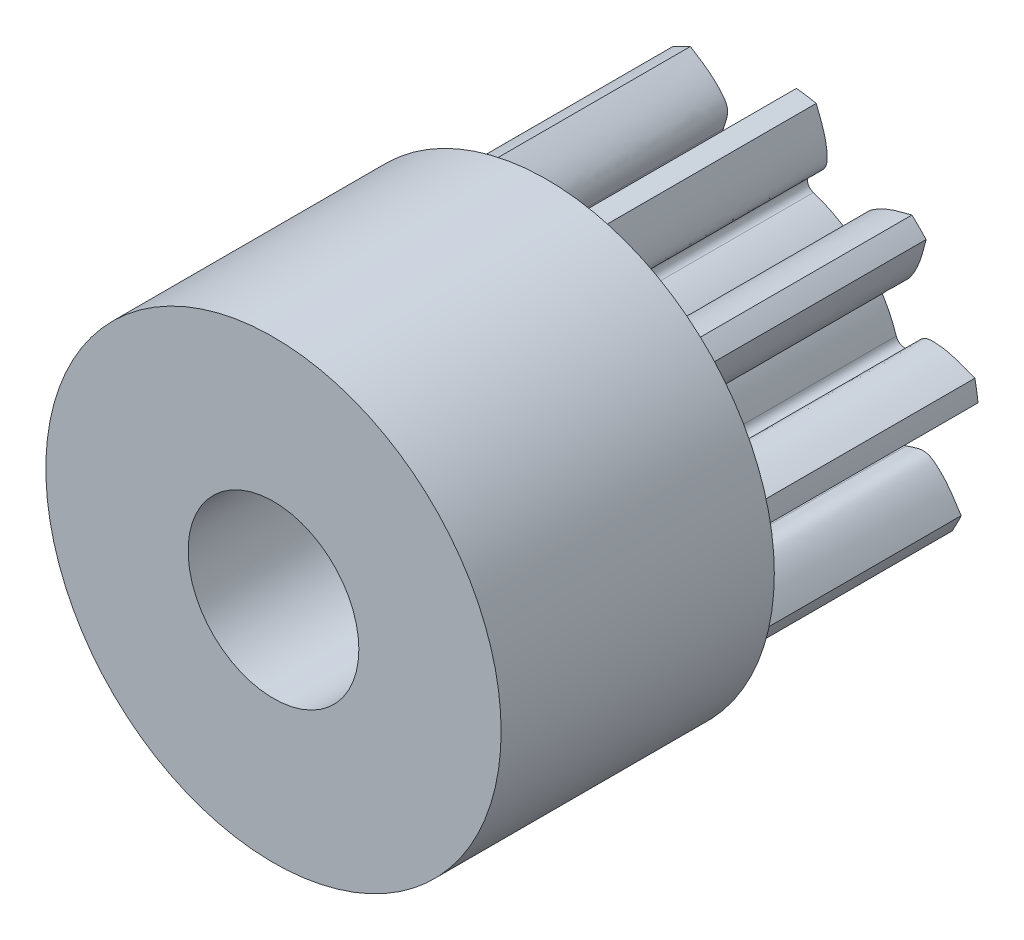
ISO-10303-21;
HEADER;
FILE_DESCRIPTION(('STEP AP214'),'2;1');
FILE_NAME('part.step','',(''),(''),'','','');
FILE_SCHEMA(('AUTOMOTIVE_DESIGN { 1 0 10303 214 1 1 1 1 }'));
ENDSEC;
DATA;
#1=APPLICATION_CONTEXT('core data for automotive mechanical design processes');
#2=APPLICATION_PROTOCOL_DEFINITION('international standard','automotive_design',2000,#1);
#3=PRODUCT_CONTEXT('',#1,'mechanical');
#4=PRODUCT('Part','Part','',(#3));
#5=PRODUCT_RELATED_PRODUCT_CATEGORY('part','',(#4));
#6=PRODUCT_DEFINITION_FORMATION('','',#4);
#7=PRODUCT_DEFINITION_CONTEXT('part definition',#1,'design');
#8=PRODUCT_DEFINITION('design','',#6,#7);
#9=PRODUCT_DEFINITION_SHAPE('','',#8);
#10=(LENGTH_UNIT() NAMED_UNIT(*) SI_UNIT(.MILLI.,.METRE.));
#11=(NAMED_UNIT(*) PLANE_ANGLE_UNIT() SI_UNIT($,.RADIAN.));
#12=(NAMED_UNIT(*) SI_UNIT($,.STERADIAN.) SOLID_ANGLE_UNIT());
#13=UNCERTAINTY_MEASURE_WITH_UNIT(LENGTH_MEASURE(1.E-05),#10,'distance_accuracy_value','');
#14=(GEOMETRIC_REPRESENTATION_CONTEXT(3) GLOBAL_UNCERTAINTY_ASSIGNED_CONTEXT((#13)) GLOBAL_UNIT_ASSIGNED_CONTEXT((#10,
#11,#12)) REPRESENTATION_CONTEXT('',''));
#15=CARTESIAN_POINT('',(0.,0.,0.));
#16=DIRECTION('',(0.,0.,1.));
#17=DIRECTION('',(1.,0.,0.));
#18=AXIS2_PLACEMENT_3D('',#15,#16,#17);
#19=CARTESIAN_POINT('',(0.,0.,2.1));
#20=DIRECTION('',(0.,0.,-1.));
#21=DIRECTION('',(-1.,0.,0.));
#22=AXIS2_PLACEMENT_3D('',#19,#20,#21);
#23=CYLINDRICAL_SURFACE('',#22,1.125);
#24=CARTESIAN_POINT('',(0.,0.,0.0999999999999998));
#25=DIRECTION('',(0.,0.,-1.));
#26=DIRECTION('',(-1.,0.,0.));
#27=AXIS2_PLACEMENT_3D('',#24,#25,#26);
#28=CIRCLE('',#27,1.125);
#29=CARTESIAN_POINT('',(0.912855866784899,-0.657509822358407,0.1));
#30=VERTEX_POINT('',#29);
#31=CARTESIAN_POINT('',(0.657364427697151,-0.912960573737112,0.0999999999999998));
#32=VERTEX_POINT('',#31);
#33=EDGE_CURVE('E1072',#30,#32,#28,.T.);
#34=ORIENTED_EDGE('',*,*,#33,.F.);
#35=DIRECTION('',(0.,0.,-1.));
#36=VECTOR('',#35,1.);
#37=CARTESIAN_POINT('',(0.912855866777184,-0.65750982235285,2.1));
#38=LINE('',#37,#36);
#39=CARTESIAN_POINT('',(0.912855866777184,-0.65750982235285,2.1));
#40=VERTEX_POINT('',#39);
#41=EDGE_CURVE('E56',#30,#40,#38,.F.);
#42=ORIENTED_EDGE('',*,*,#41,.T.);
#43=CARTESIAN_POINT('',(0.,0.,2.1));
#44=DIRECTION('',(0.,0.,1.));
#45=DIRECTION('',(1.,0.,0.));
#46=AXIS2_PLACEMENT_3D('',#43,#44,#45);
#47=CIRCLE('',#46,1.125);
#48=CARTESIAN_POINT('',(0.657364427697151,-0.912960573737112,2.1));
#49=VERTEX_POINT('',#48);
#50=EDGE_CURVE('E431',#49,#40,#47,.T.);
#51=ORIENTED_EDGE('',*,*,#50,.F.);
#52=DIRECTION('',(0.,0.,-1.));
#53=VECTOR('',#52,1.);
#54=CARTESIAN_POINT('',(0.657364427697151,-0.912960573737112,2.1));
#55=LINE('',#54,#53);
#56=EDGE_CURVE('E453',#49,#32,#55,.T.);
#57=ORIENTED_EDGE('',*,*,#56,.T.);
#58=EDGE_LOOP('',(#34,#42,#51,#57));
#59=FACE_BOUND('',#58,.T.);
#60=ADVANCED_FACE('F34',(#59),#23,.T.);
#61=CARTESIAN_POINT('',(0.,0.,0.0999999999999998));
#62=DIRECTION('',(0.,0.,-1.));
#63=DIRECTION('',(-1.,0.,0.));
#64=AXIS2_PLACEMENT_3D('',#61,#62,#63);
#65=CIRCLE('',#64,1.125);
#66=CARTESIAN_POINT('',(1.12499048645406,0.0046265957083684,0.0999999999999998));
#67=VERTEX_POINT('',#66);
#68=CARTESIAN_POINT('',(1.06844375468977,-0.352211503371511,0.1));
#69=VERTEX_POINT('',#68);
#70=EDGE_CURVE('E1052',#67,#69,#65,.T.);
#71=ORIENTED_EDGE('',*,*,#70,.F.);
#72=DIRECTION('',(0.,0.,-1.));
#73=VECTOR('',#72,1.);
#74=CARTESIAN_POINT('',(1.12499048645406,0.0046265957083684,2.1));
#75=LINE('',#74,#73);
#76=CARTESIAN_POINT('',(1.12499048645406,0.0046265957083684,2.1));
#77=VERTEX_POINT('',#76);
#78=EDGE_CURVE('E582',#67,#77,#75,.F.);
#79=ORIENTED_EDGE('',*,*,#78,.T.);
#80=CARTESIAN_POINT('',(1.06844375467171,-0.352211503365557,2.1));
#81=VERTEX_POINT('',#80);
#82=EDGE_CURVE('E588',#81,#77,#47,.T.);
#83=ORIENTED_EDGE('',*,*,#82,.F.);
#84=DIRECTION('',(0.,0.,-1.));
#85=VECTOR('',#84,1.);
#86=CARTESIAN_POINT('',(1.06844375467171,-0.352211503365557,2.1));
#87=LINE('',#86,#85);
#88=EDGE_CURVE('E438',#81,#69,#87,.T.);
#89=ORIENTED_EDGE('',*,*,#88,.T.);
#90=EDGE_LOOP('',(#71,#79,#83,#89));
#91=FACE_BOUND('',#90,.T.);
#92=ADVANCED_FACE('F669',(#91),#23,.T.);
#93=CARTESIAN_POINT('',(0.,0.,0.0999999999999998));
#94=DIRECTION('',(0.,0.,-1.));
#95=DIRECTION('',(-1.,0.,0.));
#96=AXIS2_PLACEMENT_3D('',#93,#94,#95);
#97=CIRCLE('',#96,1.125);
#98=CARTESIAN_POINT('',(0.352041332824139,-1.06849983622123,0.1));
#99=VERTEX_POINT('',#98);
#100=CARTESIAN_POINT('',(-0.00480576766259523,-1.12498973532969,0.0999999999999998));
#101=VERTEX_POINT('',#100);
#102=EDGE_CURVE('E1032',#99,#101,#97,.T.);
#103=ORIENTED_EDGE('',*,*,#102,.F.);
#104=DIRECTION('',(0.,0.,-1.));
#105=VECTOR('',#104,1.);
#106=CARTESIAN_POINT('',(0.352041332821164,-1.0684998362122,2.1));
#107=LINE('',#106,#105);
#108=CARTESIAN_POINT('',(0.352041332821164,-1.0684998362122,2.1));
#109=VERTEX_POINT('',#108);
#110=EDGE_CURVE('E446',#99,#109,#107,.F.);
#111=ORIENTED_EDGE('',*,*,#110,.T.);
#112=CARTESIAN_POINT('',(-0.00480576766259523,-1.12498973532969,2.1));
#113=VERTEX_POINT('',#112);
#114=EDGE_CURVE('E1404',#113,#109,#47,.T.);
#115=ORIENTED_EDGE('',*,*,#114,.F.);
#116=DIRECTION('',(0.,0.,-1.));
#117=VECTOR('',#116,1.);
#118=CARTESIAN_POINT('',(-0.00480576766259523,-1.12498973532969,2.1));
#119=LINE('',#118,#117);
#120=EDGE_CURVE('E469',#113,#101,#119,.T.);
#121=ORIENTED_EDGE('',*,*,#120,.T.);
#122=EDGE_LOOP('',(#103,#111,#115,#121));
#123=FACE_BOUND('',#122,.T.);
#124=ADVANCED_FACE('F675',(#123),#23,.T.);
#125=CARTESIAN_POINT('',(0.,0.,0.0999999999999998));
#126=DIRECTION('',(0.,0.,-1.));
#127=DIRECTION('',(-1.,0.,0.));
#128=AXIS2_PLACEMENT_3D('',#125,#126,#127);
#129=CIRCLE('',#128,1.125);
#130=CARTESIAN_POINT('',(-0.343241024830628,-1.07135922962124,0.1));
#131=VERTEX_POINT('',#130);
#132=CARTESIAN_POINT('',(-0.665140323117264,-0.907311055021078,0.0999999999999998));
#133=VERTEX_POINT('',#132);
#134=EDGE_CURVE('E1012',#131,#133,#129,.T.);
#135=ORIENTED_EDGE('',*,*,#134,.F.);
#136=DIRECTION('',(0.,0.,-1.));
#137=VECTOR('',#136,1.);
#138=CARTESIAN_POINT('',(-0.343241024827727,-1.07135922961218,2.1));
#139=LINE('',#138,#137);
#140=CARTESIAN_POINT('',(-0.343241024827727,-1.07135922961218,2.1));
#141=VERTEX_POINT('',#140);
#142=EDGE_CURVE('E462',#131,#141,#139,.F.);
#143=ORIENTED_EDGE('',*,*,#142,.T.);
#144=CARTESIAN_POINT('',(-0.665140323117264,-0.907311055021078,2.1));
#145=VERTEX_POINT('',#144);
#146=EDGE_CURVE('E1406',#145,#141,#47,.T.);
#147=ORIENTED_EDGE('',*,*,#146,.F.);
#148=DIRECTION('',(0.,0.,-1.));
#149=VECTOR('',#148,1.);
#150=CARTESIAN_POINT('',(-0.665140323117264,-0.907311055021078,2.1));
#151=LINE('',#150,#149);
#152=EDGE_CURVE('E485',#145,#133,#151,.T.);
#153=ORIENTED_EDGE('',*,*,#152,.T.);
#154=EDGE_LOOP('',(#135,#143,#147,#153));
#155=FACE_BOUND('',#154,.T.);
#156=ADVANCED_FACE('F1432',(#155),#23,.T.);
#157=CARTESIAN_POINT('',(0.,0.,0.0999999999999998));
#158=DIRECTION('',(0.,0.,-1.));
#159=DIRECTION('',(-1.,0.,0.));
#160=AXIS2_PLACEMENT_3D('',#157,#158,#159);
#161=CIRCLE('',#160,1.125);
#162=CARTESIAN_POINT('',(-0.907416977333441,-0.664995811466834,0.1));
#163=VERTEX_POINT('',#162);
#164=CARTESIAN_POINT('',(-1.07141388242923,-0.343070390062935,0.0999999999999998));
#165=VERTEX_POINT('',#164);
#166=EDGE_CURVE('E992',#163,#165,#161,.T.);
#167=ORIENTED_EDGE('',*,*,#166,.F.);
#168=DIRECTION('',(0.,0.,-1.));
#169=VECTOR('',#168,1.);
#170=CARTESIAN_POINT('',(-0.907416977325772,-0.664995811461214,2.1));
#171=LINE('',#170,#169);
#172=CARTESIAN_POINT('',(-0.907416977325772,-0.664995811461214,2.1));
#173=VERTEX_POINT('',#172);
#174=EDGE_CURVE('E478',#163,#173,#171,.F.);
#175=ORIENTED_EDGE('',*,*,#174,.T.);
#176=CARTESIAN_POINT('',(-1.07141388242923,-0.343070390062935,2.1));
#177=VERTEX_POINT('',#176);
#178=EDGE_CURVE('E1408',#177,#173,#47,.T.);
#179=ORIENTED_EDGE('',*,*,#178,.F.);
#180=DIRECTION('',(0.,0.,-1.));
#181=VECTOR('',#180,1.);
#182=CARTESIAN_POINT('',(-1.07141388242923,-0.343070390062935,2.1));
#183=LINE('',#182,#181);
#184=EDGE_CURVE('E501',#177,#165,#183,.T.);
#185=ORIENTED_EDGE('',*,*,#184,.T.);
#186=EDGE_LOOP('',(#167,#175,#179,#185));
#187=FACE_BOUND('',#186,.T.);
#188=ADVANCED_FACE('F1415',(#187),#23,.T.);
#189=CARTESIAN_POINT('',(0.,0.,0.0999999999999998));
#190=DIRECTION('',(0.,0.,-1.));
#191=DIRECTION('',(-1.,0.,0.));
#192=AXIS2_PLACEMENT_3D('',#189,#190,#191);
#193=CIRCLE('',#192,1.125);
#194=CARTESIAN_POINT('',(-1.12499048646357,-0.00462659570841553,0.1));
#195=VERTEX_POINT('',#194);
#196=CARTESIAN_POINT('',(-1.0684437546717,0.352211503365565,0.0999999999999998));
#197=VERTEX_POINT('',#196);
#198=EDGE_CURVE('E972',#195,#197,#193,.T.);
#199=ORIENTED_EDGE('',*,*,#198,.F.);
#200=DIRECTION('',(0.,0.,-1.));
#201=VECTOR('',#200,1.);
#202=CARTESIAN_POINT('',(-1.12499048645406,-0.00462659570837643,2.1));
#203=LINE('',#202,#201);
#204=CARTESIAN_POINT('',(-1.12499048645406,-0.00462659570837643,2.1));
#205=VERTEX_POINT('',#204);
#206=EDGE_CURVE('E494',#195,#205,#203,.F.);
#207=ORIENTED_EDGE('',*,*,#206,.T.);
#208=CARTESIAN_POINT('',(-1.0684437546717,0.352211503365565,2.1));
#209=VERTEX_POINT('',#208);
#210=EDGE_CURVE('E1289',#209,#205,#47,.T.);
#211=ORIENTED_EDGE('',*,*,#210,.F.);
#212=DIRECTION('',(0.,0.,-1.));
#213=VECTOR('',#212,1.);
#214=CARTESIAN_POINT('',(-1.0684437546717,0.352211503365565,2.1));
#215=LINE('',#214,#213);
#216=EDGE_CURVE('E517',#209,#197,#215,.T.);
#217=ORIENTED_EDGE('',*,*,#216,.T.);
#218=EDGE_LOOP('',(#199,#207,#211,#217));
#219=FACE_BOUND('',#218,.T.);
#220=ADVANCED_FACE('F1287',(#219),#23,.T.);
#221=CARTESIAN_POINT('',(0.,0.,0.0999999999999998));
#222=DIRECTION('',(0.,0.,-1.));
#223=DIRECTION('',(-1.,0.,0.));
#224=AXIS2_PLACEMENT_3D('',#221,#222,#223);
#225=CIRCLE('',#224,1.125);
#226=CARTESIAN_POINT('',(-0.912855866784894,0.657509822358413,0.1));
#227=VERTEX_POINT('',#226);
#228=CARTESIAN_POINT('',(-0.657364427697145,0.912960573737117,0.0999999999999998));
#229=VERTEX_POINT('',#228);
#230=EDGE_CURVE('E952',#227,#229,#225,.T.);
#231=ORIENTED_EDGE('',*,*,#230,.F.);
#232=DIRECTION('',(0.,0.,-1.));
#233=VECTOR('',#232,1.);
#234=CARTESIAN_POINT('',(-0.912855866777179,0.657509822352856,2.1));
#235=LINE('',#234,#233);
#236=CARTESIAN_POINT('',(-0.912855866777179,0.657509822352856,2.1));
#237=VERTEX_POINT('',#236);
#238=EDGE_CURVE('E510',#227,#237,#235,.F.);
#239=ORIENTED_EDGE('',*,*,#238,.T.);
#240=CARTESIAN_POINT('',(-0.657364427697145,0.912960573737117,2.1));
#241=VERTEX_POINT('',#240);
#242=EDGE_CURVE('E1304',#241,#237,#47,.T.);
#243=ORIENTED_EDGE('',*,*,#242,.F.);
#244=DIRECTION('',(0.,0.,-1.));
#245=VECTOR('',#244,1.);
#246=CARTESIAN_POINT('',(-0.657364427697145,0.912960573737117,2.1));
#247=LINE('',#246,#245);
#248=EDGE_CURVE('E533',#241,#229,#247,.T.);
#249=ORIENTED_EDGE('',*,*,#248,.T.);
#250=EDGE_LOOP('',(#231,#239,#243,#249));
#251=FACE_BOUND('',#250,.T.);
#252=ADVANCED_FACE('F1312',(#251),#23,.T.);
#253=CARTESIAN_POINT('',(0.,0.,0.0999999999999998));
#254=DIRECTION('',(0.,0.,-1.));
#255=DIRECTION('',(-1.,0.,0.));
#256=AXIS2_PLACEMENT_3D('',#253,#254,#255);
#257=CIRCLE('',#256,1.125);
#258=CARTESIAN_POINT('',(-0.352041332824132,1.06849983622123,0.1));
#259=VERTEX_POINT('',#258);
#260=CARTESIAN_POINT('',(0.00480576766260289,1.12498973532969,0.0999999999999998));
#261=VERTEX_POINT('',#260);
#262=EDGE_CURVE('E932',#259,#261,#257,.T.);
#263=ORIENTED_EDGE('',*,*,#262,.F.);
#264=DIRECTION('',(0.,0.,-1.));
#265=VECTOR('',#264,1.);
#266=CARTESIAN_POINT('',(-0.352041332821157,1.0684998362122,2.1));
#267=LINE('',#266,#265);
#268=CARTESIAN_POINT('',(-0.352041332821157,1.0684998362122,2.1));
#269=VERTEX_POINT('',#268);
#270=EDGE_CURVE('E526',#259,#269,#267,.F.);
#271=ORIENTED_EDGE('',*,*,#270,.T.);
#272=CARTESIAN_POINT('',(0.00480576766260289,1.12498973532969,2.1));
#273=VERTEX_POINT('',#272);
#274=EDGE_CURVE('E1328',#273,#269,#47,.T.);
#275=ORIENTED_EDGE('',*,*,#274,.F.);
#276=DIRECTION('',(0.,0.,-1.));
#277=VECTOR('',#276,1.);
#278=CARTESIAN_POINT('',(0.00480576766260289,1.12498973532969,2.1));
#279=LINE('',#278,#277);
#280=EDGE_CURVE('E549',#273,#261,#279,.T.);
#281=ORIENTED_EDGE('',*,*,#280,.T.);
#282=EDGE_LOOP('',(#263,#271,#275,#281));
#283=FACE_BOUND('',#282,.T.);
#284=ADVANCED_FACE('F686',(#283),#23,.T.);
#285=CARTESIAN_POINT('',(0.,0.,0.0999999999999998));
#286=DIRECTION('',(0.,0.,-1.));
#287=DIRECTION('',(-1.,0.,0.));
#288=AXIS2_PLACEMENT_3D('',#285,#286,#287);
#289=CIRCLE('',#288,1.125);
#290=CARTESIAN_POINT('',(0.343241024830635,1.07135922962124,0.1));
#291=VERTEX_POINT('',#290);
#292=CARTESIAN_POINT('',(0.665140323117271,0.907311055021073,0.0999999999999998));
#293=VERTEX_POINT('',#292);
#294=EDGE_CURVE('E912',#291,#293,#289,.T.);
#295=ORIENTED_EDGE('',*,*,#294,.F.);
#296=DIRECTION('',(0.,0.,-1.));
#297=VECTOR('',#296,1.);
#298=CARTESIAN_POINT('',(0.343241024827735,1.07135922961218,2.1));
#299=LINE('',#298,#297);
#300=CARTESIAN_POINT('',(0.343241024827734,1.07135922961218,2.1));
#301=VERTEX_POINT('',#300);
#302=EDGE_CURVE('E542',#291,#301,#299,.F.);
#303=ORIENTED_EDGE('',*,*,#302,.T.);
#304=CARTESIAN_POINT('',(0.665140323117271,0.907311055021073,2.1));
#305=VERTEX_POINT('',#304);
#306=EDGE_CURVE('E587',#305,#301,#47,.T.);
#307=ORIENTED_EDGE('',*,*,#306,.F.);
#308=DIRECTION('',(0.,0.,-1.));
#309=VECTOR('',#308,1.);
#310=CARTESIAN_POINT('',(0.665140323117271,0.907311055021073,2.1));
#311=LINE('',#310,#309);
#312=EDGE_CURVE('E565',#305,#293,#311,.T.);
#313=ORIENTED_EDGE('',*,*,#312,.T.);
#314=EDGE_LOOP('',(#295,#303,#307,#313));
#315=FACE_BOUND('',#314,.T.);
#316=ADVANCED_FACE('F679',(#315),#23,.T.);
#317=CARTESIAN_POINT('',(0.,0.,0.0999999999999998));
#318=DIRECTION('',(0.,0.,-1.));
#319=DIRECTION('',(-1.,0.,0.));
#320=AXIS2_PLACEMENT_3D('',#317,#318,#319);
#321=CIRCLE('',#320,1.125);
#322=CARTESIAN_POINT('',(0.907416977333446,0.664995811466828,0.1));
#323=VERTEX_POINT('',#322);
#324=CARTESIAN_POINT('',(1.07141388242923,0.343070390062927,0.0999999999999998));
#325=VERTEX_POINT('',#324);
#326=EDGE_CURVE('E689',#323,#325,#321,.T.);
#327=ORIENTED_EDGE('',*,*,#326,.F.);
#328=DIRECTION('',(0.,0.,-1.));
#329=VECTOR('',#328,1.);
#330=CARTESIAN_POINT('',(0.907416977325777,0.664995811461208,2.1));
#331=LINE('',#330,#329);
#332=CARTESIAN_POINT('',(0.907416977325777,0.664995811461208,2.1));
#333=VERTEX_POINT('',#332);
#334=EDGE_CURVE('E558',#323,#333,#331,.F.);
#335=ORIENTED_EDGE('',*,*,#334,.T.);
#336=CARTESIAN_POINT('',(1.07141388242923,0.343070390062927,2.1));
#337=VERTEX_POINT('',#336);
#338=EDGE_CURVE('E584',#337,#333,#47,.T.);
#339=ORIENTED_EDGE('',*,*,#338,.F.);
#340=DIRECTION('',(0.,0.,-1.));
#341=VECTOR('',#340,1.);
#342=CARTESIAN_POINT('',(1.07141388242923,0.343070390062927,2.1));
#343=LINE('',#342,#341);
#344=EDGE_CURVE('E579',#337,#325,#343,.T.);
#345=ORIENTED_EDGE('',*,*,#344,.T.);
#346=EDGE_LOOP('',(#327,#335,#339,#345));
#347=FACE_BOUND('',#346,.T.);
#348=ADVANCED_FACE('F670',(#347),#23,.T.);
#349=CARTESIAN_POINT('',(0.,0.,0.));
#350=DIRECTION('',(0.,0.,1.));
#351=DIRECTION('',(1.,0.,0.));
#352=AXIS2_PLACEMENT_3D('',#349,#350,#351);
#353=PLANE('',#352);
#354=CARTESIAN_POINT('',(0.,0.,0.));
#355=DIRECTION('',(0.,0.,1.));
#356=DIRECTION('',(1.,0.,0.));
#357=AXIS2_PLACEMENT_3D('',#354,#355,#356);
#358=CIRCLE('',#357,0.75);
#359=CARTESIAN_POINT('',(0.75,0.,0.));
#360=VERTEX_POINT('',#359);
#361=EDGE_CURVE('E426',#360,#360,#358,.T.);
#362=ORIENTED_EDGE('',*,*,#361,.T.);
#363=EDGE_LOOP('',(#362));
#364=FACE_BOUND('',#363,.T.);
#365=CARTESIAN_POINT('',(0.,0.,0.));
#366=DIRECTION('',(0.,0.,-1.));
#367=DIRECTION('',(-1.,0.,0.));
#368=AXIS2_PLACEMENT_3D('',#365,#366,#367);
#369=CIRCLE('',#368,0.9);
#370=CARTESIAN_POINT('',(-0.9,0.,0.));
#371=VERTEX_POINT('',#370);
#372=EDGE_CURVE('E1084',#371,#371,#369,.T.);
#373=ORIENTED_EDGE('',*,*,#372,.T.);
#374=EDGE_LOOP('',(#373));
#375=FACE_BOUND('',#374,.T.);
#376=ADVANCED_FACE('F623',(#364,#375),#353,.F.);
#377=CARTESIAN_POINT('',(1.11843324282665,0.121375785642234,2.1));
#378=CARTESIAN_POINT('',(1.1384202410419,0.116621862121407,2.1));
#379=CARTESIAN_POINT('',(1.24384221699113,0.091547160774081,2.1));
#380=CARTESIAN_POINT('',(1.34973630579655,-0.0499240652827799,2.1));
#381=CARTESIAN_POINT('',(1.58797851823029,0.0250724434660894,2.1));
#382=CARTESIAN_POINT('',(1.70060064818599,0.119594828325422,2.1));
#383=CARTESIAN_POINT('',(1.78949318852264,0.194201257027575,2.1));
#384=B_SPLINE_CURVE_WITH_KNOTS('',3,(#377,#378,#379,#380,#381,#382,#383),.UNSPECIFIED.,.F.,.F.,
(4,1,1,1,4),(0.,0.0803683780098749,0.423905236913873,0.545288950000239,1.),.UNSPECIFIED.);
#385=DIRECTION('',(0.,0.,-1.));
#386=VECTOR('',#385,1.);
#387=SURFACE_OF_LINEAR_EXTRUSION('',#384,#386);
#388=CARTESIAN_POINT('',(1.11843324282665,0.121375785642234,0.0999999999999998));
#389=CARTESIAN_POINT('',(1.1384202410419,0.116621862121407,0.0999999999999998));
#390=CARTESIAN_POINT('',(1.24384221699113,0.091547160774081,0.0999999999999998));
#391=CARTESIAN_POINT('',(1.34973630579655,-0.0499240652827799,0.0999999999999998));
#392=CARTESIAN_POINT('',(1.58797851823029,0.0250724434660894,0.0999999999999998));
#393=CARTESIAN_POINT('',(1.70060064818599,0.119594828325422,0.0999999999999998));
#394=CARTESIAN_POINT('',(1.78949318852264,0.194201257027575,0.0999999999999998));
#395=B_SPLINE_CURVE_WITH_KNOTS('',3,(#388,#389,#390,#391,#392,#393,#394),.UNSPECIFIED.,.F.,.F.,
(4,1,1,1,4),(0.,0.0803683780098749,0.423905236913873,0.545288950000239,1.),.UNSPECIFIED.);
#396=CARTESIAN_POINT('',(1.78949318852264,0.194201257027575,0.1));
#397=VERTEX_POINT('',#396);
#398=CARTESIAN_POINT('',(1.24314396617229,0.0662760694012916,0.1));
#399=VERTEX_POINT('',#398);
#400=EDGE_CURVE('E1043',#397,#399,#395,.F.);
#401=ORIENTED_EDGE('',*,*,#400,.F.);
#402=DIRECTION('',(0.,0.,-1.));
#403=VECTOR('',#402,1.);
#404=CARTESIAN_POINT('',(1.78949318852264,0.194201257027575,2.1));
#405=LINE('',#404,#403);
#406=CARTESIAN_POINT('',(1.78949318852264,0.194201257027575,2.1));
#407=VERTEX_POINT('',#406);
#408=EDGE_CURVE('E589',#407,#397,#405,.T.);
#409=ORIENTED_EDGE('',*,*,#408,.F.);
#410=CARTESIAN_POINT('',(1.24314396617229,0.0662760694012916,2.1));
#411=VERTEX_POINT('',#410);
#412=EDGE_CURVE('E626',#411,#407,#384,.T.);
#413=ORIENTED_EDGE('',*,*,#412,.F.);
#414=DIRECTION('',(0.,0.,-1.));
#415=VECTOR('',#414,1.);
#416=CARTESIAN_POINT('',(1.243143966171,0.0662760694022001,2.1));
#417=LINE('',#416,#415);
#418=EDGE_CURVE('E574',#411,#399,#417,.T.);
#419=ORIENTED_EDGE('',*,*,#418,.T.);
#420=EDGE_LOOP('',(#401,#409,#413,#419));
#421=FACE_BOUND('',#420,.T.);
#422=ADVANCED_FACE('F619',(#421),#387,.F.);
#423=CARTESIAN_POINT('',(0.,0.,2.1));
#424=DIRECTION('',(0.,0.,-1.));
#425=DIRECTION('',(-1.,0.,0.));
#426=AXIS2_PLACEMENT_3D('',#423,#424,#425);
#427=CYLINDRICAL_SURFACE('',#426,1.8);
#428=CARTESIAN_POINT('',(0.,0.,0.1));
#429=DIRECTION('',(0.,0.,-1.));
#430=DIRECTION('',(-1.,0.,0.));
#431=AXIS2_PLACEMENT_3D('',#428,#429,#430);
#432=CIRCLE('',#431,1.8);
#433=CARTESIAN_POINT('',(1.76197927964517,0.368006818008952,0.1));
#434=VERTEX_POINT('',#433);
#435=EDGE_CURVE('E1256',#434,#397,#432,.T.);
#436=ORIENTED_EDGE('',*,*,#435,.F.);
#437=DIRECTION('',(0.,0.,-1.));
#438=VECTOR('',#437,1.);
#439=CARTESIAN_POINT('',(1.76197927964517,0.368006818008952,2.1));
#440=LINE('',#439,#438);
#441=CARTESIAN_POINT('',(1.76197927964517,0.368006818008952,2.1));
#442=VERTEX_POINT('',#441);
#443=EDGE_CURVE('E592',#442,#434,#440,.T.);
#444=ORIENTED_EDGE('',*,*,#443,.F.);
#445=CARTESIAN_POINT('',(0.,0.,2.1));
#446=DIRECTION('',(0.,0.,1.));
#447=DIRECTION('',(1.,0.,0.));
#448=AXIS2_PLACEMENT_3D('',#445,#446,#447);
#449=CIRCLE('',#448,1.8);
#450=EDGE_CURVE('E601',#407,#442,#449,.T.);
#451=ORIENTED_EDGE('',*,*,#450,.F.);
#452=ORIENTED_EDGE('',*,*,#408,.T.);
#453=EDGE_LOOP('',(#436,#444,#451,#452));
#454=FACE_BOUND('',#453,.T.);
#455=ADVANCED_FACE('F612',(#454),#427,.T.);
#456=CARTESIAN_POINT('',(1.76197927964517,0.368006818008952,2.1));
#457=CARTESIAN_POINT('',(1.65438972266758,0.411509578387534,2.1));
#458=CARTESIAN_POINT('',(1.51807946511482,0.466625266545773,2.1));
#459=CARTESIAN_POINT('',(1.26832209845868,0.464370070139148,2.1));
#460=CARTESIAN_POINT('',(1.21130120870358,0.297108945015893,2.1));
#461=CARTESIAN_POINT('',(1.11877847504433,0.240699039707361,2.1));
#462=CARTESIAN_POINT('',(1.10123704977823,0.230004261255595,2.1));
#463=B_SPLINE_CURVE_WITH_KNOTS('',3,(#456,#457,#458,#459,#460,#461,#462),.UNSPECIFIED.,.F.,.F.,
(4,1,1,1,4),(0.,0.454711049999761,0.576094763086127,0.919631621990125,1.),.UNSPECIFIED.);
#464=DIRECTION('',(0.,0.,-1.));
#465=VECTOR('',#464,1.);
#466=SURFACE_OF_LINEAR_EXTRUSION('',#463,#465);
#467=CARTESIAN_POINT('',(1.76197927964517,0.368006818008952,0.0999999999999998));
#468=CARTESIAN_POINT('',(1.65438972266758,0.411509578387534,0.0999999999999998));
#469=CARTESIAN_POINT('',(1.51807946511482,0.466625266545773,0.0999999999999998));
#470=CARTESIAN_POINT('',(1.26832209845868,0.464370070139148,0.0999999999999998));
#471=CARTESIAN_POINT('',(1.21130120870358,0.297108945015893,0.0999999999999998));
#472=CARTESIAN_POINT('',(1.11877847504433,0.240699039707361,0.0999999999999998));
#473=CARTESIAN_POINT('',(1.10123704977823,0.230004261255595,0.0999999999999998));
#474=B_SPLINE_CURVE_WITH_KNOTS('',3,(#467,#468,#469,#470,#471,#472,#473),.UNSPECIFIED.,.F.,.F.,
(4,1,1,1,4),(0.,0.454711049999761,0.576094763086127,0.919631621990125,1.),.UNSPECIFIED.);
#475=CARTESIAN_POINT('',(1.20283172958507,0.320928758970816,0.1));
#476=VERTEX_POINT('',#475);
#477=EDGE_CURVE('E707',#476,#434,#474,.F.);
#478=ORIENTED_EDGE('',*,*,#477,.F.);
#479=DIRECTION('',(0.,0.,-1.));
#480=VECTOR('',#479,1.);
#481=CARTESIAN_POINT('',(1.20283172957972,0.320928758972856,0.));
#482=LINE('',#481,#480);
#483=CARTESIAN_POINT('',(1.20283172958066,0.320928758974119,2.1));
#484=VERTEX_POINT('',#483);
#485=EDGE_CURVE('E577',#476,#484,#482,.F.);
#486=ORIENTED_EDGE('',*,*,#485,.T.);
#487=EDGE_CURVE('E595',#442,#484,#463,.T.);
#488=ORIENTED_EDGE('',*,*,#487,.F.);
#489=ORIENTED_EDGE('',*,*,#443,.T.);
#490=EDGE_LOOP('',(#478,#486,#488,#489));
#491=FACE_BOUND('',#490,.T.);
#492=ADVANCED_FACE('F607',(#491),#466,.F.);
#493=CARTESIAN_POINT('',(1.14284147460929,0.365941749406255,1.05));
#494=DIRECTION('',(0.,0.,-1.));
#495=DIRECTION('',(-1.,0.,0.));
#496=AXIS2_PLACEMENT_3D('',#493,#494,#495);
#497=CYLINDRICAL_SURFACE('',#496,0.075);
#498=CARTESIAN_POINT('',(1.14284147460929,0.365941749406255,0.1));
#499=DIRECTION('',(0.,0.,-1.));
#500=DIRECTION('',(-1.,0.,0.));
#501=AXIS2_PLACEMENT_3D('',#498,#499,#500);
#502=CIRCLE('',#501,0.075);
#503=EDGE_CURVE('E694',#325,#476,#502,.F.);
#504=ORIENTED_EDGE('',*,*,#503,.F.);
#505=ORIENTED_EDGE('',*,*,#344,.F.);
#506=CARTESIAN_POINT('',(1.14284147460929,0.365941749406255,2.1));
#507=DIRECTION('',(0.,0.,1.));
#508=DIRECTION('',(1.,0.,0.));
#509=AXIS2_PLACEMENT_3D('',#506,#507,#508);
#510=CIRCLE('',#509,0.075);
#511=EDGE_CURVE('E571',#484,#337,#510,.F.);
#512=ORIENTED_EDGE('',*,*,#511,.F.);
#513=ORIENTED_EDGE('',*,*,#485,.F.);
#514=EDGE_LOOP('',(#504,#505,#512,#513));
#515=FACE_BOUND('',#514,.T.);
#516=ADVANCED_FACE('F611',(#515),#497,.F.);
#517=CARTESIAN_POINT('',(1.19998985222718,0.00493503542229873,1.05));
#518=DIRECTION('',(0.,0.,-1.));
#519=DIRECTION('',(-1.,0.,0.));
#520=AXIS2_PLACEMENT_3D('',#517,#518,#519);
#521=CYLINDRICAL_SURFACE('',#520,0.075);
#522=CARTESIAN_POINT('',(1.19998985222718,0.00493503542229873,0.1));
#523=DIRECTION('',(0.,0.,-1.));
#524=DIRECTION('',(-1.,0.,0.));
#525=AXIS2_PLACEMENT_3D('',#522,#523,#524);
#526=CIRCLE('',#525,0.075);
#527=EDGE_CURVE('E1047',#399,#67,#526,.F.);
#528=ORIENTED_EDGE('',*,*,#527,.F.);
#529=ORIENTED_EDGE('',*,*,#418,.F.);
#530=CARTESIAN_POINT('',(1.19998985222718,0.00493503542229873,2.1));
#531=DIRECTION('',(0.,0.,1.));
#532=DIRECTION('',(1.,0.,0.));
#533=AXIS2_PLACEMENT_3D('',#530,#531,#532);
#534=CIRCLE('',#533,0.075);
#535=EDGE_CURVE('E568',#77,#411,#534,.F.);
#536=ORIENTED_EDGE('',*,*,#535,.F.);
#537=ORIENTED_EDGE('',*,*,#78,.F.);
#538=EDGE_LOOP('',(#528,#529,#536,#537));
#539=FACE_BOUND('',#538,.T.);
#540=ADVANCED_FACE('F665',(#539),#521,.F.);
#541=CARTESIAN_POINT('',(0.833488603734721,0.755593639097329,2.1));
#542=CARTESIAN_POINT('',(0.852452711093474,0.763495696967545,2.1));
#543=CARTESIAN_POINT('',(0.952479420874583,0.80517532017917,2.1));
#544=CARTESIAN_POINT('',(1.12130423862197,0.752965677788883,2.1));
#545=CARTESIAN_POINT('',(1.26996439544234,0.95367438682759,2.1));
#546=CARTESIAN_POINT('',(1.30551874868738,1.09634222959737,2.1));
#547=CARTESIAN_POINT('',(1.33358176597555,1.20894982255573,2.1));
#548=B_SPLINE_CURVE_WITH_KNOTS('',3,(#541,#542,#543,#544,#545,#546,#547),.UNSPECIFIED.,.F.,.F.,
(4,1,1,1,4),(0.,0.0803683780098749,0.423905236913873,0.545288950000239,1.),.UNSPECIFIED.);
#549=DIRECTION('',(0.,0.,-1.));
#550=VECTOR('',#549,1.);
#551=SURFACE_OF_LINEAR_EXTRUSION('',#548,#550);
#552=CARTESIAN_POINT('',(0.833488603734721,0.755593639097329,0.0999999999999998));
#553=CARTESIAN_POINT('',(0.852452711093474,0.763495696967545,0.0999999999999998));
#554=CARTESIAN_POINT('',(0.952479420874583,0.80517532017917,0.0999999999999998));
#555=CARTESIAN_POINT('',(1.12130423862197,0.752965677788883,0.0999999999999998));
#556=CARTESIAN_POINT('',(1.26996439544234,0.95367438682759,0.0999999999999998));
#557=CARTESIAN_POINT('',(1.30551874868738,1.09634222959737,0.0999999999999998));
#558=CARTESIAN_POINT('',(1.33358176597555,1.20894982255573,0.0999999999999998));
#559=B_SPLINE_CURVE_WITH_KNOTS('',3,(#552,#553,#554,#555,#556,#557,#558),.UNSPECIFIED.,.F.,.F.,
(4,1,1,1,4),(0.,0.0803683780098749,0.423905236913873,0.545288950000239,1.),.UNSPECIFIED.);
#560=CARTESIAN_POINT('',(1.33358176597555,1.20894982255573,0.1));
#561=VERTEX_POINT('',#560);
#562=CARTESIAN_POINT('',(0.966768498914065,0.784320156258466,0.1));
#563=VERTEX_POINT('',#562);
#564=EDGE_CURVE('E695',#561,#563,#559,.F.);
#565=ORIENTED_EDGE('',*,*,#564,.F.);
#566=DIRECTION('',(0.,0.,-1.));
#567=VECTOR('',#566,1.);
#568=CARTESIAN_POINT('',(1.33358176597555,1.20894982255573,2.1));
#569=LINE('',#568,#567);
#570=CARTESIAN_POINT('',(1.33358176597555,1.20894982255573,2.1));
#571=VERTEX_POINT('',#570);
#572=EDGE_CURVE('E632',#571,#561,#569,.T.);
#573=ORIENTED_EDGE('',*,*,#572,.F.);
#574=CARTESIAN_POINT('',(0.966768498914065,0.784320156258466,2.1));
#575=VERTEX_POINT('',#574);
#576=EDGE_CURVE('E885',#575,#571,#548,.T.);
#577=ORIENTED_EDGE('',*,*,#576,.F.);
#578=DIRECTION('',(0.,0.,-1.));
#579=VECTOR('',#578,1.);
#580=CARTESIAN_POINT('',(0.966768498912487,0.784320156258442,2.1));
#581=LINE('',#580,#579);
#582=EDGE_CURVE('E560',#575,#563,#581,.T.);
#583=ORIENTED_EDGE('',*,*,#582,.T.);
#584=EDGE_LOOP('',(#565,#573,#577,#583));
#585=FACE_BOUND('',#584,.T.);
#586=ADVANCED_FACE('F614',(#585),#551,.F.);
#587=CARTESIAN_POINT('',(0.,0.,2.1));
#588=DIRECTION('',(0.,0.,-1.));
#589=DIRECTION('',(-1.,0.,0.));
#590=AXIS2_PLACEMENT_3D('',#587,#588,#589);
#591=CYLINDRICAL_SURFACE('',#590,1.8);
#592=CARTESIAN_POINT('',(1.20916220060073,1.33338920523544,0.1));
#593=VERTEX_POINT('',#592);
#594=EDGE_CURVE('E1255',#593,#561,#432,.T.);
#595=ORIENTED_EDGE('',*,*,#594,.F.);
#596=DIRECTION('',(0.,0.,-1.));
#597=VECTOR('',#596,1.);
#598=CARTESIAN_POINT('',(1.20916220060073,1.33338920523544,2.1));
#599=LINE('',#598,#597);
#600=CARTESIAN_POINT('',(1.20916220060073,1.33338920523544,2.1));
#601=VERTEX_POINT('',#600);
#602=EDGE_CURVE('E638',#601,#593,#599,.T.);
#603=ORIENTED_EDGE('',*,*,#602,.F.);
#604=CARTESIAN_POINT('',(0.,0.,2.1));
#605=DIRECTION('',(0.,0.,1.));
#606=DIRECTION('',(0.809016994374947,0.587785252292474,0.));
#607=AXIS2_PLACEMENT_3D('',#604,#605,#606);
#608=CIRCLE('',#607,1.8);
#609=EDGE_CURVE('E647',#571,#601,#608,.T.);
#610=ORIENTED_EDGE('',*,*,#609,.F.);
#611=ORIENTED_EDGE('',*,*,#572,.T.);
#612=EDGE_LOOP('',(#595,#603,#610,#611));
#613=FACE_BOUND('',#612,.T.);
#614=ADVANCED_FACE('F656',(#613),#591,.T.);
#615=CARTESIAN_POINT('',(1.20916220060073,1.33338920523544,2.1));
#616=CARTESIAN_POINT('',(1.09655013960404,1.30534412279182,2.1));
#617=CARTESIAN_POINT('',(0.953876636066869,1.26981249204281,2.1));
#618=CARTESIAN_POINT('',(0.753144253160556,1.12118430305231,2.1));
#619=CARTESIAN_POINT('',(0.805327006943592,0.952351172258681,2.1));
#620=CARTESIAN_POINT('',(0.763631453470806,0.852331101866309,2.1));
#621=CARTESIAN_POINT('',(0.755726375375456,0.833368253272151,2.1));
#622=B_SPLINE_CURVE_WITH_KNOTS('',3,(#615,#616,#617,#618,#619,#620,#621),.UNSPECIFIED.,.F.,.F.,
(4,1,1,1,4),(0.,0.454711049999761,0.576094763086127,0.919631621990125,1.),.UNSPECIFIED.);
#623=DIRECTION('',(0.,0.,-1.));
#624=VECTOR('',#623,1.);
#625=SURFACE_OF_LINEAR_EXTRUSION('',#622,#624);
#626=CARTESIAN_POINT('',(1.20916220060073,1.33338920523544,0.0999999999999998));
#627=CARTESIAN_POINT('',(1.09655013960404,1.30534412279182,0.0999999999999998));
#628=CARTESIAN_POINT('',(0.953876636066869,1.26981249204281,0.0999999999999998));
#629=CARTESIAN_POINT('',(0.753144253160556,1.12118430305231,0.0999999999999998));
#630=CARTESIAN_POINT('',(0.805327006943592,0.952351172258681,0.0999999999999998));
#631=CARTESIAN_POINT('',(0.763631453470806,0.852331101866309,0.0999999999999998));
#632=CARTESIAN_POINT('',(0.755726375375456,0.833368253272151,0.0999999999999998));
#633=B_SPLINE_CURVE_WITH_KNOTS('',3,(#626,#627,#628,#629,#630,#631,#632),.UNSPECIFIED.,.F.,.F.,
(4,1,1,1,4),(0.,0.454711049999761,0.576094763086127,0.919631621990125,1.),.UNSPECIFIED.);
#634=CARTESIAN_POINT('',(0.784474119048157,0.966643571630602,0.1));
#635=VERTEX_POINT('',#634);
#636=EDGE_CURVE('E896',#635,#593,#633,.F.);
#637=ORIENTED_EDGE('',*,*,#636,.F.);
#638=DIRECTION('',(0.,0.,-1.));
#639=VECTOR('',#638,1.);
#640=CARTESIAN_POINT('',(0.784474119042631,0.966643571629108,0.));
#641=LINE('',#640,#639);
#642=CARTESIAN_POINT('',(0.784474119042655,0.966643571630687,2.1));
#643=VERTEX_POINT('',#642);
#644=EDGE_CURVE('E563',#635,#643,#641,.F.);
#645=ORIENTED_EDGE('',*,*,#644,.T.);
#646=EDGE_CURVE('E641',#601,#643,#622,.T.);
#647=ORIENTED_EDGE('',*,*,#646,.F.);
#648=ORIENTED_EDGE('',*,*,#602,.T.);
#649=EDGE_LOOP('',(#637,#645,#647,#648));
#650=FACE_BOUND('',#649,.T.);
#651=ADVANCED_FACE('F652',(#650),#625,.F.);
#652=CARTESIAN_POINT('',(0.230179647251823,1.10120040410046,2.1));
#653=CARTESIAN_POINT('',(0.24087721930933,1.11874012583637,2.1));
#654=CARTESIAN_POINT('',(0.297301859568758,1.21125387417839,2.1));
#655=CARTESIAN_POINT('',(0.464572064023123,1.26824812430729,2.1));
#656=CARTESIAN_POINT('',(0.466867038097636,1.51800512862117,2.1));
#657=CARTESIAN_POINT('',(0.411773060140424,1.65432416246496,2.1));
#658=CARTESIAN_POINT('',(0.368287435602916,1.76192064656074,2.1));
#659=B_SPLINE_CURVE_WITH_KNOTS('',3,(#652,#653,#654,#655,#656,#657,#658),.UNSPECIFIED.,.F.,.F.,
(4,1,1,1,4),(0.,0.0803683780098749,0.423905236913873,0.545288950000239,1.),.UNSPECIFIED.);
#660=DIRECTION('',(0.,0.,-1.));
#661=VECTOR('',#660,1.);
#662=SURFACE_OF_LINEAR_EXTRUSION('',#659,#661);
#663=CARTESIAN_POINT('',(0.230179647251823,1.10120040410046,0.0999999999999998));
#664=CARTESIAN_POINT('',(0.24087721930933,1.11874012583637,0.0999999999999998));
#665=CARTESIAN_POINT('',(0.297301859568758,1.21125387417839,0.0999999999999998));
#666=CARTESIAN_POINT('',(0.464572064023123,1.26824812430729,0.0999999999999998));
#667=CARTESIAN_POINT('',(0.466867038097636,1.51800512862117,0.0999999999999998));
#668=CARTESIAN_POINT('',(0.411773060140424,1.65432416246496,0.0999999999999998));
#669=CARTESIAN_POINT('',(0.368287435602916,1.76192064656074,0.0999999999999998));
#670=B_SPLINE_CURVE_WITH_KNOTS('',3,(#663,#664,#665,#666,#667,#668,#669),.UNSPECIFIED.,.F.,.F.,
(4,1,1,1,4),(0.,0.0803683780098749,0.423905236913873,0.545288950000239,1.),.UNSPECIFIED.);
#671=CARTESIAN_POINT('',(0.368287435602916,1.76192064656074,0.1));
#672=VERTEX_POINT('',#671);
#673=CARTESIAN_POINT('',(0.321120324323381,1.20278060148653,0.1));
#674=VERTEX_POINT('',#673);
#675=EDGE_CURVE('E914',#672,#674,#670,.F.);
#676=ORIENTED_EDGE('',*,*,#675,.F.);
#677=DIRECTION('',(0.,0.,-1.));
#678=VECTOR('',#677,1.);
#679=CARTESIAN_POINT('',(0.368287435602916,1.76192064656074,2.1));
#680=LINE('',#679,#678);
#681=CARTESIAN_POINT('',(0.368287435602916,1.76192064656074,2.1));
#682=VERTEX_POINT('',#681);
#683=EDGE_CURVE('E883',#682,#672,#680,.T.);
#684=ORIENTED_EDGE('',*,*,#683,.F.);
#685=CARTESIAN_POINT('',(0.321120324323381,1.20278060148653,2.1));
#686=VERTEX_POINT('',#685);
#687=EDGE_CURVE('E1226',#686,#682,#659,.T.);
#688=ORIENTED_EDGE('',*,*,#687,.F.);
#689=DIRECTION('',(0.,0.,-1.));
#690=VECTOR('',#689,1.);
#691=CARTESIAN_POINT('',(0.321120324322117,1.20278060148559,2.1));
#692=LINE('',#691,#690);
#693=EDGE_CURVE('E544',#686,#674,#692,.T.);
#694=ORIENTED_EDGE('',*,*,#693,.T.);
#695=EDGE_LOOP('',(#676,#684,#688,#694));
#696=FACE_BOUND('',#695,.T.);
#697=ADVANCED_FACE('F655',(#696),#662,.F.);
#698=CARTESIAN_POINT('',(0.,0.,2.1));
#699=DIRECTION('',(0.,0.,-1.));
#700=DIRECTION('',(-1.,0.,0.));
#701=AXIS2_PLACEMENT_3D('',#698,#699,#700);
#702=CYLINDRICAL_SURFACE('',#701,1.8);
#703=CARTESIAN_POINT('',(0.194486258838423,1.7894622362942,0.1));
#704=VERTEX_POINT('',#703);
#705=EDGE_CURVE('E1243',#704,#672,#432,.T.);
#706=ORIENTED_EDGE('',*,*,#705,.F.);
#707=DIRECTION('',(0.,0.,-1.));
#708=VECTOR('',#707,1.);
#709=CARTESIAN_POINT('',(0.194486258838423,1.7894622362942,2.1));
#710=LINE('',#709,#708);
#711=CARTESIAN_POINT('',(0.194486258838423,1.7894622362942,2.1));
#712=VERTEX_POINT('',#711);
#713=EDGE_CURVE('E876',#712,#704,#710,.T.);
#714=ORIENTED_EDGE('',*,*,#713,.F.);
#715=CARTESIAN_POINT('',(0.,0.,2.1));
#716=DIRECTION('',(0.,0.,1.));
#717=DIRECTION('',(0.309016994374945,0.951056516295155,0.));
#718=AXIS2_PLACEMENT_3D('',#715,#716,#717);
#719=CIRCLE('',#718,1.8);
#720=EDGE_CURVE('E877',#682,#712,#719,.T.);
#721=ORIENTED_EDGE('',*,*,#720,.F.);
#722=ORIENTED_EDGE('',*,*,#683,.T.);
#723=EDGE_LOOP('',(#706,#714,#721,#722));
#724=FACE_BOUND('',#723,.T.);
#725=ADVANCED_FACE('F867',(#724),#702,.T.);
#726=CARTESIAN_POINT('',(0.194486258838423,1.7894622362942,2.1));
#727=CARTESIAN_POINT('',(0.119865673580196,1.70058157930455,2.1));
#728=CARTESIAN_POINT('',(0.0253253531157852,1.5879745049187,2.1));
#729=CARTESIAN_POINT('',(-0.0497090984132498,1.34974423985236,2.1));
#730=CARTESIAN_POINT('',(0.0917452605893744,1.24382762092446,2.1));
#731=CARTESIAN_POINT('',(0.116803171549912,1.13840165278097,2.1));
#732=CARTESIAN_POINT('',(0.121553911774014,1.11841389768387,2.1));
#733=B_SPLINE_CURVE_WITH_KNOTS('',3,(#726,#727,#728,#729,#730,#731,#732),.UNSPECIFIED.,.F.,.F.,
(4,1,1,1,4),(0.,0.454711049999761,0.576094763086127,0.919631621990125,1.),.UNSPECIFIED.);
#734=DIRECTION('',(0.,0.,-1.));
#735=VECTOR('',#734,1.);
#736=SURFACE_OF_LINEAR_EXTRUSION('',#733,#735);
#737=CARTESIAN_POINT('',(0.194486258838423,1.7894622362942,0.0999999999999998));
#738=CARTESIAN_POINT('',(0.119865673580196,1.70058157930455,0.0999999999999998));
#739=CARTESIAN_POINT('',(0.0253253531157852,1.5879745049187,0.0999999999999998));
#740=CARTESIAN_POINT('',(-0.0497090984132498,1.34974423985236,0.0999999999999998));
#741=CARTESIAN_POINT('',(0.0917452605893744,1.24382762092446,0.0999999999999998));
#742=CARTESIAN_POINT('',(0.116803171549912,1.13840165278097,0.0999999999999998));
#743=CARTESIAN_POINT('',(0.121553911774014,1.11841389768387,0.0999999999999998));
#744=B_SPLINE_CURVE_WITH_KNOTS('',3,(#737,#738,#739,#740,#741,#742,#743),.UNSPECIFIED.,.F.,.F.,
(4,1,1,1,4),(0.,0.454711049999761,0.576094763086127,0.919631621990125,1.),.UNSPECIFIED.);
#745=CARTESIAN_POINT('',(0.0664740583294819,1.24313339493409,0.1));
#746=VERTEX_POINT('',#745);
#747=EDGE_CURVE('E923',#746,#704,#744,.F.);
#748=ORIENTED_EDGE('',*,*,#747,.F.);
#749=DIRECTION('',(0.,0.,-1.));
#750=VECTOR('',#749,1.);
#751=CARTESIAN_POINT('',(0.0664740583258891,1.24313339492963,0.));
#752=LINE('',#751,#750);
#753=CARTESIAN_POINT('',(0.0664740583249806,1.24313339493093,2.1));
#754=VERTEX_POINT('',#753);
#755=EDGE_CURVE('E547',#746,#754,#752,.F.);
#756=ORIENTED_EDGE('',*,*,#755,.T.);
#757=EDGE_CURVE('E869',#712,#754,#733,.T.);
#758=ORIENTED_EDGE('',*,*,#757,.F.);
#759=ORIENTED_EDGE('',*,*,#713,.T.);
#760=EDGE_LOOP('',(#748,#756,#758,#759));
#761=FACE_BOUND('',#760,.T.);
#762=ADVANCED_FACE('F862',(#761),#736,.F.);
#763=CARTESIAN_POINT('',(-0.461050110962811,1.02618604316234,2.1));
#764=CARTESIAN_POINT('',(-0.462705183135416,1.04666385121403,2.1));
#765=CARTESIAN_POINT('',(-0.471434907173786,1.15467461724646,2.1));
#766=CARTESIAN_POINT('',(-0.369610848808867,1.29910289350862,2.1));
#767=CARTESIAN_POINT('',(-0.514557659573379,1.50250950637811,2.1));
#768=CARTESIAN_POINT('',(-0.639255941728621,1.58041049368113,2.1));
#769=CARTESIAN_POINT('',(-0.737680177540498,1.64189766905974,2.1));
#770=B_SPLINE_CURVE_WITH_KNOTS('',3,(#763,#764,#765,#766,#767,#768,#769),.UNSPECIFIED.,.F.,.F.,
(4,1,1,1,4),(0.,0.0803683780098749,0.423905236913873,0.545288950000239,1.),.UNSPECIFIED.);
#771=DIRECTION('',(0.,0.,-1.));
#772=VECTOR('',#771,1.);
#773=SURFACE_OF_LINEAR_EXTRUSION('',#770,#772);
#774=CARTESIAN_POINT('',(-0.461050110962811,1.02618604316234,0.0999999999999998));
#775=CARTESIAN_POINT('',(-0.462705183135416,1.04666385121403,0.0999999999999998));
#776=CARTESIAN_POINT('',(-0.471434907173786,1.15467461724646,0.0999999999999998));
#777=CARTESIAN_POINT('',(-0.369610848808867,1.29910289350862,0.0999999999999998));
#778=CARTESIAN_POINT('',(-0.514557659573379,1.50250950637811,0.0999999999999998));
#779=CARTESIAN_POINT('',(-0.639255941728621,1.58041049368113,0.0999999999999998));
#780=CARTESIAN_POINT('',(-0.737680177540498,1.64189766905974,0.0999999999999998));
#781=B_SPLINE_CURVE_WITH_KNOTS('',3,(#774,#775,#776,#777,#778,#779,#780),.UNSPECIFIED.,.F.,.F.,
(4,1,1,1,4),(0.,0.0803683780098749,0.423905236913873,0.545288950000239,1.),.UNSPECIFIED.);
#782=CARTESIAN_POINT('',(-0.737680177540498,1.64189766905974,0.1));
#783=VERTEX_POINT('',#782);
#784=CARTESIAN_POINT('',(-0.447184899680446,1.16181973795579,0.1));
#785=VERTEX_POINT('',#784);
#786=EDGE_CURVE('E934',#783,#785,#781,.F.);
#787=ORIENTED_EDGE('',*,*,#786,.F.);
#788=DIRECTION('',(0.,0.,-1.));
#789=VECTOR('',#788,1.);
#790=CARTESIAN_POINT('',(-0.737680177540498,1.64189766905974,2.1));
#791=LINE('',#790,#789);
#792=CARTESIAN_POINT('',(-0.737680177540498,1.64189766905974,2.1));
#793=VERTEX_POINT('',#792);
#794=EDGE_CURVE('E1224',#793,#783,#791,.T.);
#795=ORIENTED_EDGE('',*,*,#794,.F.);
#796=CARTESIAN_POINT('',(-0.447184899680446,1.16181973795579,2.1));
#797=VERTEX_POINT('',#796);
#798=EDGE_CURVE('E845',#797,#793,#770,.T.);
#799=ORIENTED_EDGE('',*,*,#798,.F.);
#800=DIRECTION('',(0.,0.,-1.));
#801=VECTOR('',#800,1.);
#802=CARTESIAN_POINT('',(-0.447184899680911,1.16181973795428,2.1));
#803=LINE('',#802,#801);
#804=EDGE_CURVE('E528',#797,#785,#803,.T.);
#805=ORIENTED_EDGE('',*,*,#804,.T.);
#806=EDGE_LOOP('',(#787,#795,#799,#805));
#807=FACE_BOUND('',#806,.T.);
#808=ADVANCED_FACE('F857',(#807),#773,.F.);
#809=CARTESIAN_POINT('',(0.,0.,2.1));
#810=DIRECTION('',(0.,0.,-1.));
#811=DIRECTION('',(-1.,0.,0.));
#812=AXIS2_PLACEMENT_3D('',#809,#810,#811);
#813=CYLINDRICAL_SURFACE('',#812,1.8);
#814=CARTESIAN_POINT('',(-0.894476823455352,1.56202151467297,0.1));
#815=VERTEX_POINT('',#814);
#816=EDGE_CURVE('E1082',#815,#783,#432,.T.);
#817=ORIENTED_EDGE('',*,*,#816,.F.);
#818=DIRECTION('',(0.,0.,-1.));
#819=VECTOR('',#818,1.);
#820=CARTESIAN_POINT('',(-0.894476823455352,1.56202151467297,2.1));
#821=LINE('',#820,#819);
#822=CARTESIAN_POINT('',(-0.894476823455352,1.56202151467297,2.1));
#823=VERTEX_POINT('',#822);
#824=EDGE_CURVE('E1218',#823,#815,#821,.T.);
#825=ORIENTED_EDGE('',*,*,#824,.F.);
#826=CARTESIAN_POINT('',(0.,0.,2.1));
#827=DIRECTION('',(0.,0.,1.));
#828=DIRECTION('',(-0.309016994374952,0.951056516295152,0.));
#829=AXIS2_PLACEMENT_3D('',#826,#827,#828);
#830=CIRCLE('',#829,1.8);
#831=EDGE_CURVE('E851',#793,#823,#830,.T.);
#832=ORIENTED_EDGE('',*,*,#831,.F.);
#833=ORIENTED_EDGE('',*,*,#794,.T.);
#834=EDGE_LOOP('',(#817,#825,#832,#833));
#835=FACE_BOUND('',#834,.T.);
#836=ADVANCED_FACE('F861',(#835),#813,.T.);
#837=CARTESIAN_POINT('',(-0.894476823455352,1.56202151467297,2.1));
#838=CARTESIAN_POINT('',(-0.902603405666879,1.44625467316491,2.1));
#839=CARTESIAN_POINT('',(-0.912899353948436,1.29958423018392,2.1));
#840=CARTESIAN_POINT('',(-0.833575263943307,1.06274775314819,2.1));
#841=CARTESIAN_POINT('',(-0.656880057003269,1.06020419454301,2.1));
#842=CARTESIAN_POINT('',(-0.574639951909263,0.989641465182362,2.1));
#843=CARTESIAN_POINT('',(-0.559048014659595,0.976263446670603,2.1));
#844=B_SPLINE_CURVE_WITH_KNOTS('',3,(#837,#838,#839,#840,#841,#842,#843),.UNSPECIFIED.,.F.,.F.,
(4,1,1,1,4),(0.,0.454711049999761,0.576094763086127,0.919631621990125,1.),.UNSPECIFIED.);
#845=DIRECTION('',(0.,0.,-1.));
#846=VECTOR('',#845,1.);
#847=SURFACE_OF_LINEAR_EXTRUSION('',#844,#846);
#848=CARTESIAN_POINT('',(-0.894476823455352,1.56202151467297,0.0999999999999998));
#849=CARTESIAN_POINT('',(-0.902603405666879,1.44625467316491,0.0999999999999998));
#850=CARTESIAN_POINT('',(-0.912899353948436,1.29958423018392,0.0999999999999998));
#851=CARTESIAN_POINT('',(-0.833575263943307,1.06274775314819,0.0999999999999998));
#852=CARTESIAN_POINT('',(-0.656880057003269,1.06020419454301,0.0999999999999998));
#853=CARTESIAN_POINT('',(-0.574639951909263,0.989641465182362,0.0999999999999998));
#854=CARTESIAN_POINT('',(-0.559048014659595,0.976263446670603,0.0999999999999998));
#855=B_SPLINE_CURVE_WITH_KNOTS('',3,(#848,#849,#850,#851,#852,#853,#854),.UNSPECIFIED.,.F.,.F.,
(4,1,1,1,4),(0.,0.454711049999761,0.576094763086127,0.919631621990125,1.),.UNSPECIFIED.);
#856=CARTESIAN_POINT('',(-0.676916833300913,1.0447885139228,0.1));
#857=VERTEX_POINT('',#856);
#858=EDGE_CURVE('E943',#857,#815,#855,.F.);
#859=ORIENTED_EDGE('',*,*,#858,.F.);
#860=DIRECTION('',(0.,0.,-1.));
#861=VECTOR('',#860,1.);
#862=CARTESIAN_POINT('',(-0.6769168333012,1.04478851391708,0.));
#863=LINE('',#862,#861);
#864=CARTESIAN_POINT('',(-0.676916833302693,1.04478851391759,2.1));
#865=VERTEX_POINT('',#864);
#866=EDGE_CURVE('E531',#857,#865,#863,.F.);
#867=ORIENTED_EDGE('',*,*,#866,.T.);
#868=EDGE_CURVE('E1212',#823,#865,#844,.T.);
#869=ORIENTED_EDGE('',*,*,#868,.F.);
#870=ORIENTED_EDGE('',*,*,#824,.T.);
#871=EDGE_LOOP('',(#859,#867,#869,#870));
#872=FACE_BOUND('',#871,.T.);
#873=ADVANCED_FACE('F1208',(#872),#847,.F.);
#874=CARTESIAN_POINT('',(-0.976174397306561,0.559203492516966,2.1));
#875=CARTESIAN_POINT('',(-0.989549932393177,0.574797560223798,2.1));
#876=CARTESIAN_POINT('',(-1.06009956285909,0.657048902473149,2.1));
#877=CARTESIAN_POINT('',(-1.06261498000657,0.833744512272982,2.1));
#878=CARTESIAN_POINT('',(-1.29943882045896,0.913106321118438,2.1));
#879=CARTESIAN_POINT('',(-1.44611090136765,0.902833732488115,2.1));
#880=CARTESIAN_POINT('',(-1.5618790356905,0.894725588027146,2.1));
#881=B_SPLINE_CURVE_WITH_KNOTS('',3,(#874,#875,#876,#877,#878,#879,#880),.UNSPECIFIED.,.F.,.F.,
(4,1,1,1,4),(0.,0.0803683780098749,0.423905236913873,0.545288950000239,1.),.UNSPECIFIED.);
#882=DIRECTION('',(0.,0.,-1.));
#883=VECTOR('',#882,1.);
#884=SURFACE_OF_LINEAR_EXTRUSION('',#881,#883);
#885=CARTESIAN_POINT('',(-0.976174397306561,0.559203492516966,0.0999999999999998));
#886=CARTESIAN_POINT('',(-0.989549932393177,0.574797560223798,0.0999999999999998));
#887=CARTESIAN_POINT('',(-1.06009956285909,0.657048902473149,0.0999999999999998));
#888=CARTESIAN_POINT('',(-1.06261498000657,0.833744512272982,0.0999999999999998));
#889=CARTESIAN_POINT('',(-1.29943882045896,0.913106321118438,0.0999999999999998));
#890=CARTESIAN_POINT('',(-1.44611090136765,0.902833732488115,0.0999999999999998));
#891=CARTESIAN_POINT('',(-1.5618790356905,0.894725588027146,0.0999999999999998));
#892=B_SPLINE_CURVE_WITH_KNOTS('',3,(#885,#886,#887,#888,#889,#890,#891),.UNSPECIFIED.,.F.,.F.,
(4,1,1,1,4),(0.,0.0803683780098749,0.423905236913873,0.545288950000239,1.),.UNSPECIFIED.);
#893=CARTESIAN_POINT('',(-1.5618790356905,0.894725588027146,0.1));
#894=VERTEX_POINT('',#893);
#895=CARTESIAN_POINT('',(-1.04468069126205,0.677083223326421,0.1));
#896=VERTEX_POINT('',#895);
#897=EDGE_CURVE('E954',#894,#896,#892,.F.);
#898=ORIENTED_EDGE('',*,*,#897,.F.);
#899=DIRECTION('',(0.,0.,-1.));
#900=VECTOR('',#899,1.);
#901=CARTESIAN_POINT('',(-1.5618790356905,0.894725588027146,2.1));
#902=LINE('',#901,#900);
#903=CARTESIAN_POINT('',(-1.5618790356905,0.894725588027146,2.1));
#904=VERTEX_POINT('',#903);
#905=EDGE_CURVE('E842',#904,#894,#902,.T.);
#906=ORIENTED_EDGE('',*,*,#905,.F.);
#907=CARTESIAN_POINT('',(-1.04468069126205,0.677083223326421,2.1));
#908=VERTEX_POINT('',#907);
#909=EDGE_CURVE('E1198',#908,#904,#881,.T.);
#910=ORIENTED_EDGE('',*,*,#909,.F.);
#911=DIRECTION('',(0.,0.,-1.));
#912=VECTOR('',#911,1.);
#913=CARTESIAN_POINT('',(-1.04468069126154,0.677083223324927,2.1));
#914=LINE('',#913,#912);
#915=EDGE_CURVE('E512',#908,#896,#914,.T.);
#916=ORIENTED_EDGE('',*,*,#915,.T.);
#917=EDGE_LOOP('',(#898,#906,#910,#916));
#918=FACE_BOUND('',#917,.T.);
#919=ADVANCED_FACE('F1206',(#918),#884,.F.);
#920=CARTESIAN_POINT('',(0.,0.,2.1));
#921=DIRECTION('',(0.,0.,-1.));
#922=DIRECTION('',(-1.,0.,0.));
#923=AXIS2_PLACEMENT_3D('',#920,#921,#922);
#924=CYLINDRICAL_SURFACE('',#923,1.8);
#925=CARTESIAN_POINT('',(-1.64178016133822,0.737941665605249,0.1));
#926=VERTEX_POINT('',#925);
#927=EDGE_CURVE('E1077',#926,#894,#432,.T.);
#928=ORIENTED_EDGE('',*,*,#927,.F.);
#929=DIRECTION('',(0.,0.,-1.));
#930=VECTOR('',#929,1.);
#931=CARTESIAN_POINT('',(-1.64178016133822,0.737941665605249,2.1));
#932=LINE('',#931,#930);
#933=CARTESIAN_POINT('',(-1.64178016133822,0.737941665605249,2.1));
#934=VERTEX_POINT('',#933);
#935=EDGE_CURVE('E834',#934,#926,#932,.T.);
#936=ORIENTED_EDGE('',*,*,#935,.F.);
#937=CARTESIAN_POINT('',(0.,0.,2.1));
#938=DIRECTION('',(0.,0.,1.));
#939=DIRECTION('',(-0.809016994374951,0.587785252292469,0.));
#940=AXIS2_PLACEMENT_3D('',#937,#938,#939);
#941=CIRCLE('',#940,1.8);
#942=EDGE_CURVE('E835',#904,#934,#941,.T.);
#943=ORIENTED_EDGE('',*,*,#942,.F.);
#944=ORIENTED_EDGE('',*,*,#905,.T.);
#945=EDGE_LOOP('',(#928,#936,#943,#944));
#946=FACE_BOUND('',#945,.T.);
#947=ADVANCED_FACE('F824',(#946),#924,.T.);
#948=CARTESIAN_POINT('',(-1.64178016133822,0.737941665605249,2.1));
#949=CARTESIAN_POINT('',(-1.58030866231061,0.639507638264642,2.1));
#950=CARTESIAN_POINT('',(-1.50242753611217,0.514796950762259,2.1));
#951=CARTESIAN_POINT('',(-1.29904401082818,0.369817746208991,2.1));
#952=CARTESIAN_POINT('',(-1.15459951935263,0.471618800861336,2.1));
#953=CARTESIAN_POINT('',(-1.0465901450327,0.462871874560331,2.1));
#954=CARTESIAN_POINT('',(-1.02611260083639,0.46121354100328,2.1));
#955=B_SPLINE_CURVE_WITH_KNOTS('',3,(#948,#949,#950,#951,#952,#953,#954),.UNSPECIFIED.,.F.,.F.,
(4,1,1,1,4),(0.,0.454711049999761,0.576094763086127,0.919631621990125,1.),.UNSPECIFIED.);
#956=DIRECTION('',(0.,0.,-1.));
#957=VECTOR('',#956,1.);
#958=SURFACE_OF_LINEAR_EXTRUSION('',#955,#957);
#959=CARTESIAN_POINT('',(-1.64178016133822,0.737941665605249,0.0999999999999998));
#960=CARTESIAN_POINT('',(-1.58030866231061,0.639507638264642,0.0999999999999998));
#961=CARTESIAN_POINT('',(-1.50242753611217,0.514796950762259,0.0999999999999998));
#962=CARTESIAN_POINT('',(-1.29904401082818,0.369817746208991,0.0999999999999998));
#963=CARTESIAN_POINT('',(-1.15459951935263,0.471618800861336,0.0999999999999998));
#964=CARTESIAN_POINT('',(-1.0465901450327,0.462871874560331,0.0999999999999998));
#965=CARTESIAN_POINT('',(-1.02611260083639,0.46121354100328,0.0999999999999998));
#966=B_SPLINE_CURVE_WITH_KNOTS('',3,(#959,#960,#961,#962,#963,#964,#965),.UNSPECIFIED.,.F.,.F.,
(4,1,1,1,4),(0.,0.454711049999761,0.576094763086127,0.919631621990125,1.),.UNSPECIFIED.);
#967=CARTESIAN_POINT('',(-1.1617485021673,0.447369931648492,0.1));
#968=VERTEX_POINT('',#967);
#969=EDGE_CURVE('E963',#968,#926,#966,.F.);
#970=ORIENTED_EDGE('',*,*,#969,.F.);
#971=DIRECTION('',(0.,0.,-1.));
#972=VECTOR('',#971,1.);
#973=CARTESIAN_POINT('',(-1.16174850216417,0.447369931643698,0.));
#974=LINE('',#973,#972);
#975=CARTESIAN_POINT('',(-1.16174850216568,0.447369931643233,2.1));
#976=VERTEX_POINT('',#975);
#977=EDGE_CURVE('E515',#968,#976,#974,.F.);
#978=ORIENTED_EDGE('',*,*,#977,.T.);
#979=EDGE_CURVE('E827',#934,#976,#955,.T.);
#980=ORIENTED_EDGE('',*,*,#979,.F.);
#981=ORIENTED_EDGE('',*,*,#935,.T.);
#982=EDGE_LOOP('',(#970,#978,#980,#981));
#983=FACE_BOUND('',#982,.T.);
#984=ADVANCED_FACE('F818',(#983),#958,.F.);
#985=CARTESIAN_POINT('',(-1.11843324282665,-0.121375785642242,2.1));
#986=CARTESIAN_POINT('',(-1.1384202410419,-0.116621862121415,2.1));
#987=CARTESIAN_POINT('',(-1.24384221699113,-0.0915471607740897,2.1));
#988=CARTESIAN_POINT('',(-1.34973630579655,0.0499240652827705,2.1));
#989=CARTESIAN_POINT('',(-1.58797851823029,-0.0250724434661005,2.1));
#990=CARTESIAN_POINT('',(-1.70060064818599,-0.119594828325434,2.1));
#991=CARTESIAN_POINT('',(-1.78949318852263,-0.194201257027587,2.1));
#992=B_SPLINE_CURVE_WITH_KNOTS('',3,(#985,#986,#987,#988,#989,#990,#991),.UNSPECIFIED.,.F.,.F.,
(4,1,1,1,4),(0.,0.0803683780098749,0.423905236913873,0.545288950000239,1.),.UNSPECIFIED.);
#993=DIRECTION('',(0.,0.,-1.));
#994=VECTOR('',#993,1.);
#995=SURFACE_OF_LINEAR_EXTRUSION('',#992,#994);
#996=CARTESIAN_POINT('',(-1.11843324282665,-0.121375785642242,0.0999999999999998));
#997=CARTESIAN_POINT('',(-1.1384202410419,-0.116621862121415,0.0999999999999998));
#998=CARTESIAN_POINT('',(-1.24384221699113,-0.0915471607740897,0.0999999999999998));
#999=CARTESIAN_POINT('',(-1.34973630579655,0.0499240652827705,0.0999999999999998));
#1000=CARTESIAN_POINT('',(-1.58797851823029,-0.0250724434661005,0.0999999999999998));
#1001=CARTESIAN_POINT('',(-1.70060064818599,-0.119594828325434,0.0999999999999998));
#1002=CARTESIAN_POINT('',(-1.78949318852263,-0.194201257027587,0.0999999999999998));
#1003=B_SPLINE_CURVE_WITH_KNOTS('',3,(#996,#997,#998,#999,#1000,#1001,#1002),.UNSPECIFIED.,.F.,
.F.,(4,1,1,1,4),(0.,0.0803683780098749,0.423905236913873,0.545288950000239,1.),.UNSPECIFIED.);
#1004=CARTESIAN_POINT('',(-1.78949318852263,-0.194201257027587,0.1));
#1005=VERTEX_POINT('',#1004);
#1006=CARTESIAN_POINT('',(-1.24314396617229,-0.0662760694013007,0.1));
#1007=VERTEX_POINT('',#1006);
#1008=EDGE_CURVE('E974',#1005,#1007,#1003,.F.);
#1009=ORIENTED_EDGE('',*,*,#1008,.F.);
#1010=DIRECTION('',(0.,0.,-1.));
#1011=VECTOR('',#1010,1.);
#1012=CARTESIAN_POINT('',(-1.78949318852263,-0.194201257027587,2.1));
#1013=LINE('',#1012,#1011);
#1014=CARTESIAN_POINT('',(-1.78949318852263,-0.194201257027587,2.1));
#1015=VERTEX_POINT('',#1014);
#1016=EDGE_CURVE('E1196',#1015,#1005,#1013,.T.);
#1017=ORIENTED_EDGE('',*,*,#1016,.F.);
#1018=CARTESIAN_POINT('',(-1.24314396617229,-0.0662760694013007,2.1));
#1019=VERTEX_POINT('',#1018);
#1020=EDGE_CURVE('E801',#1019,#1015,#992,.T.);
#1021=ORIENTED_EDGE('',*,*,#1020,.F.);
#1022=DIRECTION('',(0.,0.,-1.));
#1023=VECTOR('',#1022,1.);
#1024=CARTESIAN_POINT('',(-1.243143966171,-0.0662760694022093,2.1));
#1025=LINE('',#1024,#1023);
#1026=EDGE_CURVE('E496',#1019,#1007,#1025,.T.);
#1027=ORIENTED_EDGE('',*,*,#1026,.T.);
#1028=EDGE_LOOP('',(#1009,#1017,#1021,#1027));
#1029=FACE_BOUND('',#1028,.T.);
#1030=ADVANCED_FACE('F813',(#1029),#995,.F.);
#1031=CARTESIAN_POINT('',(0.,0.,2.1));
#1032=DIRECTION('',(0.,0.,-1.));
#1033=DIRECTION('',(-1.,0.,0.));
#1034=AXIS2_PLACEMENT_3D('',#1031,#1032,#1033);
#1035=CYLINDRICAL_SURFACE('',#1034,1.8);
#1036=CARTESIAN_POINT('',(-1.76197927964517,-0.368006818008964,0.1));
#1037=VERTEX_POINT('',#1036);
#1038=EDGE_CURVE('E1083',#1037,#1005,#432,.T.);
#1039=ORIENTED_EDGE('',*,*,#1038,.F.);
#1040=DIRECTION('',(0.,0.,-1.));
#1041=VECTOR('',#1040,1.);
#1042=CARTESIAN_POINT('',(-1.76197927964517,-0.368006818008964,2.1));
#1043=LINE('',#1042,#1041);
#1044=CARTESIAN_POINT('',(-1.76197927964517,-0.368006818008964,2.1));
#1045=VERTEX_POINT('',#1044);
#1046=EDGE_CURVE('E1190',#1045,#1037,#1043,.T.);
#1047=ORIENTED_EDGE('',*,*,#1046,.F.);
#1048=CARTESIAN_POINT('',(0.,0.,2.1));
#1049=DIRECTION('',(0.,0.,1.));
#1050=DIRECTION('',(-1.,0.,0.));
#1051=AXIS2_PLACEMENT_3D('',#1048,#1049,#1050);
#1052=CIRCLE('',#1051,1.8);
#1053=EDGE_CURVE('E807',#1015,#1045,#1052,.T.);
#1054=ORIENTED_EDGE('',*,*,#1053,.F.);
#1055=ORIENTED_EDGE('',*,*,#1016,.T.);
#1056=EDGE_LOOP('',(#1039,#1047,#1054,#1055));
#1057=FACE_BOUND('',#1056,.T.);
#1058=ADVANCED_FACE('F817',(#1057),#1035,.T.);
#1059=CARTESIAN_POINT('',(-1.76197927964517,-0.368006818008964,2.1));
#1060=CARTESIAN_POINT('',(-1.65438972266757,-0.411509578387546,2.1));
#1061=CARTESIAN_POINT('',(-1.51807946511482,-0.466625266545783,2.1));
#1062=CARTESIAN_POINT('',(-1.26832209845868,-0.464370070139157,2.1));
#1063=CARTESIAN_POINT('',(-1.21130120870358,-0.297108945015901,2.1));
#1064=CARTESIAN_POINT('',(-1.11877847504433,-0.240699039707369,2.1));
#1065=CARTESIAN_POINT('',(-1.10123704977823,-0.230004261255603,2.1));
#1066=B_SPLINE_CURVE_WITH_KNOTS('',3,(#1059,#1060,#1061,#1062,#1063,#1064,#1065),.UNSPECIFIED.,
.F.,.F.,(4,1,1,1,4),(0.,0.454711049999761,0.576094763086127,0.919631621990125,1.),.UNSPECIFIED.);
#1067=DIRECTION('',(0.,0.,-1.));
#1068=VECTOR('',#1067,1.);
#1069=SURFACE_OF_LINEAR_EXTRUSION('',#1066,#1068);
#1070=CARTESIAN_POINT('',(-1.76197927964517,-0.368006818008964,0.0999999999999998));
#1071=CARTESIAN_POINT('',(-1.65438972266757,-0.411509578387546,0.0999999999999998));
#1072=CARTESIAN_POINT('',(-1.51807946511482,-0.466625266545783,0.0999999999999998));
#1073=CARTESIAN_POINT('',(-1.26832209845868,-0.464370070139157,0.0999999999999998));
#1074=CARTESIAN_POINT('',(-1.21130120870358,-0.297108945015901,0.0999999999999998));
#1075=CARTESIAN_POINT('',(-1.11877847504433,-0.240699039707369,0.0999999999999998));
#1076=CARTESIAN_POINT('',(-1.10123704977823,-0.230004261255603,0.0999999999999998));
#1077=B_SPLINE_CURVE_WITH_KNOTS('',3,(#1070,#1071,#1072,#1073,#1074,#1075,#1076),.UNSPECIFIED.,
.F.,.F.,(4,1,1,1,4),(0.,0.454711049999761,0.576094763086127,0.919631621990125,1.),.UNSPECIFIED.);
#1078=CARTESIAN_POINT('',(-1.20283172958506,-0.320928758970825,0.1));
#1079=VERTEX_POINT('',#1078);
#1080=EDGE_CURVE('E983',#1079,#1037,#1077,.F.);
#1081=ORIENTED_EDGE('',*,*,#1080,.F.);
#1082=DIRECTION('',(0.,0.,-1.));
#1083=VECTOR('',#1082,1.);
#1084=CARTESIAN_POINT('',(-1.20283172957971,-0.320928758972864,0.));
#1085=LINE('',#1084,#1083);
#1086=CARTESIAN_POINT('',(-1.20283172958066,-0.320928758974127,2.1));
#1087=VERTEX_POINT('',#1086);
#1088=EDGE_CURVE('E499',#1079,#1087,#1085,.F.);
#1089=ORIENTED_EDGE('',*,*,#1088,.T.);
#1090=EDGE_CURVE('E1184',#1045,#1087,#1066,.T.);
#1091=ORIENTED_EDGE('',*,*,#1090,.F.);
#1092=ORIENTED_EDGE('',*,*,#1046,.T.);
#1093=EDGE_LOOP('',(#1081,#1089,#1091,#1092));
#1094=FACE_BOUND('',#1093,.T.);
#1095=ADVANCED_FACE('F1180',(#1094),#1069,.F.);
#1096=CARTESIAN_POINT('',(-0.833488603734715,-0.755593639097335,2.1));
#1097=CARTESIAN_POINT('',(-0.852452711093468,-0.763495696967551,2.1));
#1098=CARTESIAN_POINT('',(-0.952479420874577,-0.805175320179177,2.1));
#1099=CARTESIAN_POINT('',(-1.12130423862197,-0.752965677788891,2.1));
#1100=CARTESIAN_POINT('',(-1.26996439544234,-0.9536743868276,2.1));
#1101=CARTESIAN_POINT('',(-1.30551874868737,-1.09634222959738,2.1));
#1102=CARTESIAN_POINT('',(-1.33358176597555,-1.20894982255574,2.1));
#1103=B_SPLINE_CURVE_WITH_KNOTS('',3,(#1096,#1097,#1098,#1099,#1100,#1101,#1102),.UNSPECIFIED.,
.F.,.F.,(4,1,1,1,4),(0.,0.0803683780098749,0.423905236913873,0.545288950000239,1.),.UNSPECIFIED.);
#1104=DIRECTION('',(0.,0.,-1.));
#1105=VECTOR('',#1104,1.);
#1106=SURFACE_OF_LINEAR_EXTRUSION('',#1103,#1105);
#1107=CARTESIAN_POINT('',(-0.833488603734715,-0.755593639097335,0.0999999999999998));
#1108=CARTESIAN_POINT('',(-0.852452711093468,-0.763495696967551,0.0999999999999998));
#1109=CARTESIAN_POINT('',(-0.952479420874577,-0.805175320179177,0.0999999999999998));
#1110=CARTESIAN_POINT('',(-1.12130423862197,-0.752965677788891,0.0999999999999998));
#1111=CARTESIAN_POINT('',(-1.26996439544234,-0.9536743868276,0.0999999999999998));
#1112=CARTESIAN_POINT('',(-1.30551874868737,-1.09634222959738,0.0999999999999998));
#1113=CARTESIAN_POINT('',(-1.33358176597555,-1.20894982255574,0.0999999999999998));
#1114=B_SPLINE_CURVE_WITH_KNOTS('',3,(#1107,#1108,#1109,#1110,#1111,#1112,#1113),.UNSPECIFIED.,
.F.,.F.,(4,1,1,1,4),(0.,0.0803683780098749,0.423905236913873,0.545288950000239,1.),.UNSPECIFIED.);
#1115=CARTESIAN_POINT('',(-1.33358176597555,-1.20894982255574,0.1));
#1116=VERTEX_POINT('',#1115);
#1117=CARTESIAN_POINT('',(-0.96676849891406,-0.784320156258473,0.1));
#1118=VERTEX_POINT('',#1117);
#1119=EDGE_CURVE('E994',#1116,#1118,#1114,.F.);
#1120=ORIENTED_EDGE('',*,*,#1119,.F.);
#1121=DIRECTION('',(0.,0.,-1.));
#1122=VECTOR('',#1121,1.);
#1123=CARTESIAN_POINT('',(-1.33358176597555,-1.20894982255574,2.1));
#1124=LINE('',#1123,#1122);
#1125=CARTESIAN_POINT('',(-1.33358176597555,-1.20894982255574,2.1));
#1126=VERTEX_POINT('',#1125);
#1127=EDGE_CURVE('E798',#1126,#1116,#1124,.T.);
#1128=ORIENTED_EDGE('',*,*,#1127,.F.);
#1129=CARTESIAN_POINT('',(-0.96676849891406,-0.784320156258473,2.1));
#1130=VERTEX_POINT('',#1129);
#1131=EDGE_CURVE('E1170',#1130,#1126,#1103,.T.);
#1132=ORIENTED_EDGE('',*,*,#1131,.F.);
#1133=DIRECTION('',(0.,0.,-1.));
#1134=VECTOR('',#1133,1.);
#1135=CARTESIAN_POINT('',(-0.966768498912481,-0.784320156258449,2.1));
#1136=LINE('',#1135,#1134);
#1137=EDGE_CURVE('E480',#1130,#1118,#1136,.T.);
#1138=ORIENTED_EDGE('',*,*,#1137,.T.);
#1139=EDGE_LOOP('',(#1120,#1128,#1132,#1138));
#1140=FACE_BOUND('',#1139,.T.);
#1141=ADVANCED_FACE('F1178',(#1140),#1106,.F.);
#1142=CARTESIAN_POINT('',(0.,0.,2.1));
#1143=DIRECTION('',(0.,0.,-1.));
#1144=DIRECTION('',(-1.,0.,0.));
#1145=AXIS2_PLACEMENT_3D('',#1142,#1143,#1144);
#1146=CYLINDRICAL_SURFACE('',#1145,1.8);
#1147=CARTESIAN_POINT('',(-1.20916220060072,-1.33338920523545,0.1));
#1148=VERTEX_POINT('',#1147);
#1149=EDGE_CURVE('E1265',#1148,#1116,#432,.T.);
#1150=ORIENTED_EDGE('',*,*,#1149,.F.);
#1151=DIRECTION('',(0.,0.,-1.));
#1152=VECTOR('',#1151,1.);
#1153=CARTESIAN_POINT('',(-1.20916220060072,-1.33338920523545,2.1));
#1154=LINE('',#1153,#1152);
#1155=CARTESIAN_POINT('',(-1.20916220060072,-1.33338920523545,2.1));
#1156=VERTEX_POINT('',#1155);
#1157=EDGE_CURVE('E790',#1156,#1148,#1154,.T.);
#1158=ORIENTED_EDGE('',*,*,#1157,.F.);
#1159=CARTESIAN_POINT('',(0.,0.,2.1));
#1160=DIRECTION('',(0.,0.,1.));
#1161=DIRECTION('',(-0.809016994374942,-0.58778525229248,0.));
#1162=AXIS2_PLACEMENT_3D('',#1159,#1160,#1161);
#1163=CIRCLE('',#1162,1.8);
#1164=EDGE_CURVE('E791',#1126,#1156,#1163,.T.);
#1165=ORIENTED_EDGE('',*,*,#1164,.F.);
#1166=ORIENTED_EDGE('',*,*,#1127,.T.);
#1167=EDGE_LOOP('',(#1150,#1158,#1165,#1166));
#1168=FACE_BOUND('',#1167,.T.);
#1169=ADVANCED_FACE('F780',(#1168),#1146,.T.);
#1170=CARTESIAN_POINT('',(-1.20916220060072,-1.33338920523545,2.1));
#1171=CARTESIAN_POINT('',(-1.09655013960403,-1.30534412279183,2.1));
#1172=CARTESIAN_POINT('',(-0.953876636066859,-1.26981249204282,2.1));
#1173=CARTESIAN_POINT('',(-0.753144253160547,-1.12118430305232,2.1));
#1174=CARTESIAN_POINT('',(-0.805327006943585,-0.952351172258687,2.1));
#1175=CARTESIAN_POINT('',(-0.763631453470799,-0.852331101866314,2.1));
#1176=CARTESIAN_POINT('',(-0.75572637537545,-0.833368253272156,2.1));
#1177=B_SPLINE_CURVE_WITH_KNOTS('',3,(#1170,#1171,#1172,#1173,#1174,#1175,#1176),.UNSPECIFIED.,
.F.,.F.,(4,1,1,1,4),(0.,0.454711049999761,0.576094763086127,0.919631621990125,1.),.UNSPECIFIED.);
#1178=DIRECTION('',(0.,0.,-1.));
#1179=VECTOR('',#1178,1.);
#1180=SURFACE_OF_LINEAR_EXTRUSION('',#1177,#1179);
#1181=CARTESIAN_POINT('',(-1.20916220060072,-1.33338920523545,0.0999999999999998));
#1182=CARTESIAN_POINT('',(-1.09655013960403,-1.30534412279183,0.0999999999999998));
#1183=CARTESIAN_POINT('',(-0.953876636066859,-1.26981249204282,0.0999999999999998));
#1184=CARTESIAN_POINT('',(-0.753144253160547,-1.12118430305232,0.0999999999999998));
#1185=CARTESIAN_POINT('',(-0.805327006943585,-0.952351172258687,0.0999999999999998));
#1186=CARTESIAN_POINT('',(-0.763631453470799,-0.852331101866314,0.0999999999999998));
#1187=CARTESIAN_POINT('',(-0.75572637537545,-0.833368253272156,0.0999999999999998));
#1188=B_SPLINE_CURVE_WITH_KNOTS('',3,(#1181,#1182,#1183,#1184,#1185,#1186,#1187),.UNSPECIFIED.,
.F.,.F.,(4,1,1,1,4),(0.,0.454711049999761,0.576094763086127,0.919631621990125,1.),.UNSPECIFIED.);
#1189=CARTESIAN_POINT('',(-0.78447411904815,-0.966643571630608,0.1));
#1190=VERTEX_POINT('',#1189);
#1191=EDGE_CURVE('E1003',#1190,#1148,#1188,.F.);
#1192=ORIENTED_EDGE('',*,*,#1191,.F.);
#1193=DIRECTION('',(0.,0.,-1.));
#1194=VECTOR('',#1193,1.);
#1195=CARTESIAN_POINT('',(-0.784474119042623,-0.966643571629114,0.));
#1196=LINE('',#1195,#1194);
#1197=CARTESIAN_POINT('',(-0.784474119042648,-0.966643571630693,2.1));
#1198=VERTEX_POINT('',#1197);
#1199=EDGE_CURVE('E483',#1190,#1198,#1196,.F.);
#1200=ORIENTED_EDGE('',*,*,#1199,.T.);
#1201=EDGE_CURVE('E783',#1156,#1198,#1177,.T.);
#1202=ORIENTED_EDGE('',*,*,#1201,.F.);
#1203=ORIENTED_EDGE('',*,*,#1157,.T.);
#1204=EDGE_LOOP('',(#1192,#1200,#1202,#1203));
#1205=FACE_BOUND('',#1204,.T.);
#1206=ADVANCED_FACE('F774',(#1205),#1180,.F.);
#1207=CARTESIAN_POINT('',(-0.230179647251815,-1.10120040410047,2.1));
#1208=CARTESIAN_POINT('',(-0.240877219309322,-1.11874012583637,2.1));
#1209=CARTESIAN_POINT('',(-0.297301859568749,-1.2112538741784,2.1));
#1210=CARTESIAN_POINT('',(-0.464572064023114,-1.2682481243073,2.1));
#1211=CARTESIAN_POINT('',(-0.466867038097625,-1.51800512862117,2.1));
#1212=CARTESIAN_POINT('',(-0.411773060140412,-1.65432416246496,2.1));
#1213=CARTESIAN_POINT('',(-0.368287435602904,-1.76192064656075,2.1));
#1214=B_SPLINE_CURVE_WITH_KNOTS('',3,(#1207,#1208,#1209,#1210,#1211,#1212,#1213),.UNSPECIFIED.,
.F.,.F.,(4,1,1,1,4),(0.,0.0803683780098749,0.423905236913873,0.545288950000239,1.),.UNSPECIFIED.);
#1215=DIRECTION('',(0.,0.,-1.));
#1216=VECTOR('',#1215,1.);
#1217=SURFACE_OF_LINEAR_EXTRUSION('',#1214,#1216);
#1218=CARTESIAN_POINT('',(-0.230179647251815,-1.10120040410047,0.0999999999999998));
#1219=CARTESIAN_POINT('',(-0.240877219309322,-1.11874012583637,0.0999999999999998));
#1220=CARTESIAN_POINT('',(-0.297301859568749,-1.2112538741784,0.0999999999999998));
#1221=CARTESIAN_POINT('',(-0.464572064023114,-1.2682481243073,0.0999999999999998));
#1222=CARTESIAN_POINT('',(-0.466867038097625,-1.51800512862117,0.0999999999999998));
#1223=CARTESIAN_POINT('',(-0.411773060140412,-1.65432416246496,0.0999999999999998));
#1224=CARTESIAN_POINT('',(-0.368287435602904,-1.76192064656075,0.0999999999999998));
#1225=B_SPLINE_CURVE_WITH_KNOTS('',3,(#1218,#1219,#1220,#1221,#1222,#1223,#1224),.UNSPECIFIED.,
.F.,.F.,(4,1,1,1,4),(0.,0.0803683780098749,0.423905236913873,0.545288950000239,1.),.UNSPECIFIED.);
#1226=CARTESIAN_POINT('',(-0.368287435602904,-1.76192064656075,0.1));
#1227=VERTEX_POINT('',#1226);
#1228=CARTESIAN_POINT('',(-0.321120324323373,-1.20278060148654,0.1));
#1229=VERTEX_POINT('',#1228);
#1230=EDGE_CURVE('E1014',#1227,#1229,#1225,.F.);
#1231=ORIENTED_EDGE('',*,*,#1230,.F.);
#1232=DIRECTION('',(0.,0.,-1.));
#1233=VECTOR('',#1232,1.);
#1234=CARTESIAN_POINT('',(-0.368287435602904,-1.76192064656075,2.1));
#1235=LINE('',#1234,#1233);
#1236=CARTESIAN_POINT('',(-0.368287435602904,-1.76192064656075,2.1));
#1237=VERTEX_POINT('',#1236);
#1238=EDGE_CURVE('E1168',#1237,#1227,#1235,.T.);
#1239=ORIENTED_EDGE('',*,*,#1238,.F.);
#1240=CARTESIAN_POINT('',(-0.321120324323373,-1.20278060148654,2.1));
#1241=VERTEX_POINT('',#1240);
#1242=EDGE_CURVE('E757',#1241,#1237,#1214,.T.);
#1243=ORIENTED_EDGE('',*,*,#1242,.F.);
#1244=DIRECTION('',(0.,0.,-1.));
#1245=VECTOR('',#1244,1.);
#1246=CARTESIAN_POINT('',(-0.32112032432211,-1.20278060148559,2.1));
#1247=LINE('',#1246,#1245);
#1248=EDGE_CURVE('E464',#1241,#1229,#1247,.T.);
#1249=ORIENTED_EDGE('',*,*,#1248,.T.);
#1250=EDGE_LOOP('',(#1231,#1239,#1243,#1249));
#1251=FACE_BOUND('',#1250,.T.);
#1252=ADVANCED_FACE('F769',(#1251),#1217,.F.);
#1253=CARTESIAN_POINT('',(0.,0.,2.1));
#1254=DIRECTION('',(0.,0.,-1.));
#1255=DIRECTION('',(-1.,0.,0.));
#1256=AXIS2_PLACEMENT_3D('',#1253,#1254,#1255);
#1257=CYLINDRICAL_SURFACE('',#1256,1.8);
#1258=CARTESIAN_POINT('',(-0.194486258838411,-1.7894622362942,0.1));
#1259=VERTEX_POINT('',#1258);
#1260=EDGE_CURVE('E1262',#1259,#1227,#432,.T.);
#1261=ORIENTED_EDGE('',*,*,#1260,.F.);
#1262=DIRECTION('',(0.,0.,-1.));
#1263=VECTOR('',#1262,1.);
#1264=CARTESIAN_POINT('',(-0.194486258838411,-1.7894622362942,2.1));
#1265=LINE('',#1264,#1263);
#1266=CARTESIAN_POINT('',(-0.194486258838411,-1.7894622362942,2.1));
#1267=VERTEX_POINT('',#1266);
#1268=EDGE_CURVE('E1162',#1267,#1259,#1265,.T.);
#1269=ORIENTED_EDGE('',*,*,#1268,.F.);
#1270=CARTESIAN_POINT('',(0.,0.,2.1));
#1271=DIRECTION('',(0.,0.,1.));
#1272=DIRECTION('',(-0.309016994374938,-0.951056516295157,0.));
#1273=AXIS2_PLACEMENT_3D('',#1270,#1271,#1272);
#1274=CIRCLE('',#1273,1.8);
#1275=EDGE_CURVE('E763',#1237,#1267,#1274,.T.);
#1276=ORIENTED_EDGE('',*,*,#1275,.F.);
#1277=ORIENTED_EDGE('',*,*,#1238,.T.);
#1278=EDGE_LOOP('',(#1261,#1269,#1276,#1277));
#1279=FACE_BOUND('',#1278,.T.);
#1280=ADVANCED_FACE('F773',(#1279),#1257,.T.);
#1281=CARTESIAN_POINT('',(-0.194486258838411,-1.7894622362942,2.1));
#1282=CARTESIAN_POINT('',(-0.119865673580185,-1.70058157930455,2.1));
#1283=CARTESIAN_POINT('',(-0.0253253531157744,-1.5879745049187,2.1));
#1284=CARTESIAN_POINT('',(0.0497090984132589,-1.34974423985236,2.1));
#1285=CARTESIAN_POINT('',(-0.0917452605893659,-1.24382762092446,2.1));
#1286=CARTESIAN_POINT('',(-0.116803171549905,-1.13840165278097,2.1));
#1287=CARTESIAN_POINT('',(-0.121553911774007,-1.11841389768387,2.1));
#1288=B_SPLINE_CURVE_WITH_KNOTS('',3,(#1281,#1282,#1283,#1284,#1285,#1286,#1287),.UNSPECIFIED.,
.F.,.F.,(4,1,1,1,4),(0.,0.454711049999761,0.576094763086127,0.919631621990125,1.),.UNSPECIFIED.);
#1289=DIRECTION('',(0.,0.,-1.));
#1290=VECTOR('',#1289,1.);
#1291=SURFACE_OF_LINEAR_EXTRUSION('',#1288,#1290);
#1292=CARTESIAN_POINT('',(-0.194486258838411,-1.7894622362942,0.0999999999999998));
#1293=CARTESIAN_POINT('',(-0.119865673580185,-1.70058157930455,0.0999999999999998));
#1294=CARTESIAN_POINT('',(-0.0253253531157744,-1.5879745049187,0.0999999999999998));
#1295=CARTESIAN_POINT('',(0.0497090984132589,-1.34974423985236,0.0999999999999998));
#1296=CARTESIAN_POINT('',(-0.0917452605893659,-1.24382762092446,0.0999999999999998));
#1297=CARTESIAN_POINT('',(-0.116803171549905,-1.13840165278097,0.0999999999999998));
#1298=CARTESIAN_POINT('',(-0.121553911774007,-1.11841389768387,0.0999999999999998));
#1299=B_SPLINE_CURVE_WITH_KNOTS('',3,(#1292,#1293,#1294,#1295,#1296,#1297,#1298),.UNSPECIFIED.,
.F.,.F.,(4,1,1,1,4),(0.,0.454711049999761,0.576094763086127,0.919631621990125,1.),.UNSPECIFIED.);
#1300=CARTESIAN_POINT('',(-0.0664740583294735,-1.24313339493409,0.1));
#1301=VERTEX_POINT('',#1300);
#1302=EDGE_CURVE('E1023',#1301,#1259,#1299,.F.);
#1303=ORIENTED_EDGE('',*,*,#1302,.F.);
#1304=DIRECTION('',(0.,0.,-1.));
#1305=VECTOR('',#1304,1.);
#1306=CARTESIAN_POINT('',(-0.0664740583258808,-1.24313339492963,0.));
#1307=LINE('',#1306,#1305);
#1308=CARTESIAN_POINT('',(-0.0664740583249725,-1.24313339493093,2.1));
#1309=VERTEX_POINT('',#1308);
#1310=EDGE_CURVE('E467',#1301,#1309,#1307,.F.);
#1311=ORIENTED_EDGE('',*,*,#1310,.T.);
#1312=EDGE_CURVE('E1156',#1267,#1309,#1288,.T.);
#1313=ORIENTED_EDGE('',*,*,#1312,.F.);
#1314=ORIENTED_EDGE('',*,*,#1268,.T.);
#1315=EDGE_LOOP('',(#1303,#1311,#1313,#1314));
#1316=FACE_BOUND('',#1315,.T.);
#1317=ADVANCED_FACE('F1152',(#1316),#1291,.F.);
#1318=CARTESIAN_POINT('',(0.461050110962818,-1.02618604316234,2.1));
#1319=CARTESIAN_POINT('',(0.462705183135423,-1.04666385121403,2.1));
#1320=CARTESIAN_POINT('',(0.471434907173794,-1.15467461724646,2.1));
#1321=CARTESIAN_POINT('',(0.369610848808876,-1.29910289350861,2.1));
#1322=CARTESIAN_POINT('',(0.514557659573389,-1.5025095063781,2.1));
#1323=CARTESIAN_POINT('',(0.639255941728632,-1.58041049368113,2.1));
#1324=CARTESIAN_POINT('',(0.73768017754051,-1.64189766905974,2.1));
#1325=B_SPLINE_CURVE_WITH_KNOTS('',3,(#1318,#1319,#1320,#1321,#1322,#1323,#1324),.UNSPECIFIED.,
.F.,.F.,(4,1,1,1,4),(0.,0.0803683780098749,0.423905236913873,0.545288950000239,1.),.UNSPECIFIED.);
#1326=DIRECTION('',(0.,0.,-1.));
#1327=VECTOR('',#1326,1.);
#1328=SURFACE_OF_LINEAR_EXTRUSION('',#1325,#1327);
#1329=CARTESIAN_POINT('',(0.461050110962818,-1.02618604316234,0.0999999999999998));
#1330=CARTESIAN_POINT('',(0.462705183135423,-1.04666385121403,0.0999999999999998));
#1331=CARTESIAN_POINT('',(0.471434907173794,-1.15467461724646,0.0999999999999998));
#1332=CARTESIAN_POINT('',(0.369610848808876,-1.29910289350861,0.0999999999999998));
#1333=CARTESIAN_POINT('',(0.514557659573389,-1.5025095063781,0.0999999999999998));
#1334=CARTESIAN_POINT('',(0.639255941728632,-1.58041049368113,0.0999999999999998));
#1335=CARTESIAN_POINT('',(0.73768017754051,-1.64189766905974,0.0999999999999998));
#1336=B_SPLINE_CURVE_WITH_KNOTS('',3,(#1329,#1330,#1331,#1332,#1333,#1334,#1335),.UNSPECIFIED.,
.F.,.F.,(4,1,1,1,4),(0.,0.0803683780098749,0.423905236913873,0.545288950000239,1.),.UNSPECIFIED.);
#1337=CARTESIAN_POINT('',(0.73768017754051,-1.64189766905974,0.1));
#1338=VERTEX_POINT('',#1337);
#1339=CARTESIAN_POINT('',(0.447184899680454,-1.16181973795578,0.1));
#1340=VERTEX_POINT('',#1339);
#1341=EDGE_CURVE('E1034',#1338,#1340,#1336,.F.);
#1342=ORIENTED_EDGE('',*,*,#1341,.F.);
#1343=DIRECTION('',(0.,0.,-1.));
#1344=VECTOR('',#1343,1.);
#1345=CARTESIAN_POINT('',(0.73768017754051,-1.64189766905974,2.1));
#1346=LINE('',#1345,#1344);
#1347=CARTESIAN_POINT('',(0.73768017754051,-1.64189766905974,2.1));
#1348=VERTEX_POINT('',#1347);
#1349=EDGE_CURVE('E754',#1348,#1338,#1346,.T.);
#1350=ORIENTED_EDGE('',*,*,#1349,.F.);
#1351=CARTESIAN_POINT('',(0.447184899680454,-1.16181973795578,2.1));
#1352=VERTEX_POINT('',#1351);
#1353=EDGE_CURVE('E1142',#1352,#1348,#1325,.T.);
#1354=ORIENTED_EDGE('',*,*,#1353,.F.);
#1355=DIRECTION('',(0.,0.,-1.));
#1356=VECTOR('',#1355,1.);
#1357=CARTESIAN_POINT('',(0.447184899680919,-1.16181973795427,2.1));
#1358=LINE('',#1357,#1356);
#1359=EDGE_CURVE('E448',#1352,#1340,#1358,.T.);
#1360=ORIENTED_EDGE('',*,*,#1359,.T.);
#1361=EDGE_LOOP('',(#1342,#1350,#1354,#1360));
#1362=FACE_BOUND('',#1361,.T.);
#1363=ADVANCED_FACE('F1150',(#1362),#1328,.F.);
#1364=CARTESIAN_POINT('',(0.,0.,2.1));
#1365=DIRECTION('',(0.,0.,-1.));
#1366=DIRECTION('',(-1.,0.,0.));
#1367=AXIS2_PLACEMENT_3D('',#1364,#1365,#1366);
#1368=CYLINDRICAL_SURFACE('',#1367,1.8);
#1369=CARTESIAN_POINT('',(0.894476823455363,-1.56202151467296,0.1));
#1370=VERTEX_POINT('',#1369);
#1371=EDGE_CURVE('E1260',#1370,#1338,#432,.T.);
#1372=ORIENTED_EDGE('',*,*,#1371,.F.);
#1373=DIRECTION('',(0.,0.,-1.));
#1374=VECTOR('',#1373,1.);
#1375=CARTESIAN_POINT('',(0.894476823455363,-1.56202151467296,2.1));
#1376=LINE('',#1375,#1374);
#1377=CARTESIAN_POINT('',(0.894476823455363,-1.56202151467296,2.1));
#1378=VERTEX_POINT('',#1377);
#1379=EDGE_CURVE('E746',#1378,#1370,#1376,.T.);
#1380=ORIENTED_EDGE('',*,*,#1379,.F.);
#1381=CARTESIAN_POINT('',(0.,0.,2.1));
#1382=DIRECTION('',(0.,0.,1.));
#1383=DIRECTION('',(0.309016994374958,-0.95105651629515,0.));
#1384=AXIS2_PLACEMENT_3D('',#1381,#1382,#1383);
#1385=CIRCLE('',#1384,1.8);
#1386=EDGE_CURVE('E747',#1348,#1378,#1385,.T.);
#1387=ORIENTED_EDGE('',*,*,#1386,.F.);
#1388=ORIENTED_EDGE('',*,*,#1349,.T.);
#1389=EDGE_LOOP('',(#1372,#1380,#1387,#1388));
#1390=FACE_BOUND('',#1389,.T.);
#1391=ADVANCED_FACE('F736',(#1390),#1368,.T.);
#1392=CARTESIAN_POINT('',(0.894476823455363,-1.56202151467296,2.1));
#1393=CARTESIAN_POINT('',(0.902603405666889,-1.4462546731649,2.1));
#1394=CARTESIAN_POINT('',(0.912899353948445,-1.29958423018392,2.1));
#1395=CARTESIAN_POINT('',(0.833575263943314,-1.06274775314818,2.1));
#1396=CARTESIAN_POINT('',(0.656880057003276,-1.060204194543,2.1));
#1397=CARTESIAN_POINT('',(0.57463995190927,-0.989641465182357,2.1));
#1398=CARTESIAN_POINT('',(0.559048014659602,-0.976263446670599,2.1));
#1399=B_SPLINE_CURVE_WITH_KNOTS('',3,(#1392,#1393,#1394,#1395,#1396,#1397,#1398),.UNSPECIFIED.,
.F.,.F.,(4,1,1,1,4),(0.,0.454711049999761,0.576094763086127,0.919631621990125,1.),.UNSPECIFIED.);
#1400=DIRECTION('',(0.,0.,-1.));
#1401=VECTOR('',#1400,1.);
#1402=SURFACE_OF_LINEAR_EXTRUSION('',#1399,#1401);
#1403=CARTESIAN_POINT('',(0.894476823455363,-1.56202151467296,0.0999999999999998));
#1404=CARTESIAN_POINT('',(0.902603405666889,-1.4462546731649,0.0999999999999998));
#1405=CARTESIAN_POINT('',(0.912899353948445,-1.29958423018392,0.0999999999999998));
#1406=CARTESIAN_POINT('',(0.833575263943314,-1.06274775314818,0.0999999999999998));
#1407=CARTESIAN_POINT('',(0.656880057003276,-1.060204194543,0.0999999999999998));
#1408=CARTESIAN_POINT('',(0.57463995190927,-0.989641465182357,0.0999999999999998));
#1409=CARTESIAN_POINT('',(0.559048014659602,-0.976263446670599,0.0999999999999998));
#1410=B_SPLINE_CURVE_WITH_KNOTS('',3,(#1403,#1404,#1405,#1406,#1407,#1408,#1409),.UNSPECIFIED.,
.F.,.F.,(4,1,1,1,4),(0.,0.454711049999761,0.576094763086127,0.919631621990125,1.),.UNSPECIFIED.);
#1411=CARTESIAN_POINT('',(0.67691683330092,-1.0447885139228,0.1));
#1412=VERTEX_POINT('',#1411);
#1413=EDGE_CURVE('E1063',#1412,#1370,#1410,.F.);
#1414=ORIENTED_EDGE('',*,*,#1413,.F.);
#1415=DIRECTION('',(0.,0.,-1.));
#1416=VECTOR('',#1415,1.);
#1417=CARTESIAN_POINT('',(0.676916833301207,-1.04478851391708,0.));
#1418=LINE('',#1417,#1416);
#1419=CARTESIAN_POINT('',(0.676916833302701,-1.04478851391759,2.1));
#1420=VERTEX_POINT('',#1419);
#1421=EDGE_CURVE('E451',#1412,#1420,#1418,.F.);
#1422=ORIENTED_EDGE('',*,*,#1421,.T.);
#1423=EDGE_CURVE('E739',#1378,#1420,#1399,.T.);
#1424=ORIENTED_EDGE('',*,*,#1423,.F.);
#1425=ORIENTED_EDGE('',*,*,#1379,.T.);
#1426=EDGE_LOOP('',(#1414,#1422,#1424,#1425));
#1427=FACE_BOUND('',#1426,.T.);
#1428=ADVANCED_FACE('F731',(#1427),#1402,.F.);
#1429=CARTESIAN_POINT('',(0.976174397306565,-0.559203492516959,2.1));
#1430=CARTESIAN_POINT('',(0.989549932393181,-0.57479756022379,2.1));
#1431=CARTESIAN_POINT('',(1.0600995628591,-0.657048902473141,2.1));
#1432=CARTESIAN_POINT('',(1.06261498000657,-0.833744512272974,2.1));
#1433=CARTESIAN_POINT('',(1.29943882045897,-0.913106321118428,2.1));
#1434=CARTESIAN_POINT('',(1.44611090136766,-0.902833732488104,2.1));
#1435=CARTESIAN_POINT('',(1.5618790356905,-0.894725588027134,2.1));
#1436=B_SPLINE_CURVE_WITH_KNOTS('',3,(#1429,#1430,#1431,#1432,#1433,#1434,#1435),.UNSPECIFIED.,
.F.,.F.,(4,1,1,1,4),(0.,0.0803683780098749,0.423905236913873,0.545288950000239,1.),.UNSPECIFIED.);
#1437=DIRECTION('',(0.,0.,-1.));
#1438=VECTOR('',#1437,1.);
#1439=SURFACE_OF_LINEAR_EXTRUSION('',#1436,#1438);
#1440=CARTESIAN_POINT('',(0.976174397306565,-0.559203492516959,0.0999999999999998));
#1441=CARTESIAN_POINT('',(0.989549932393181,-0.57479756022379,0.0999999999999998));
#1442=CARTESIAN_POINT('',(1.0600995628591,-0.657048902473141,0.0999999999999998));
#1443=CARTESIAN_POINT('',(1.06261498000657,-0.833744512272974,0.0999999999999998));
#1444=CARTESIAN_POINT('',(1.29943882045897,-0.913106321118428,0.0999999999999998));
#1445=CARTESIAN_POINT('',(1.44611090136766,-0.902833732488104,0.0999999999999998));
#1446=CARTESIAN_POINT('',(1.5618790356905,-0.894725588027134,0.0999999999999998));
#1447=B_SPLINE_CURVE_WITH_KNOTS('',3,(#1440,#1441,#1442,#1443,#1444,#1445,#1446),.UNSPECIFIED.,
.F.,.F.,(4,1,1,1,4),(0.,0.0803683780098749,0.423905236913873,0.545288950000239,1.),.UNSPECIFIED.);
#1448=CARTESIAN_POINT('',(1.5618790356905,-0.894725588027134,0.1));
#1449=VERTEX_POINT('',#1448);
#1450=CARTESIAN_POINT('',(1.04468069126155,-0.67708322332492,0.1));
#1451=VERTEX_POINT('',#1450);
#1452=EDGE_CURVE('E48',#1449,#1451,#1447,.F.);
#1453=ORIENTED_EDGE('',*,*,#1452,.F.);
#1454=DIRECTION('',(0.,0.,-1.));
#1455=VECTOR('',#1454,1.);
#1456=CARTESIAN_POINT('',(1.5618790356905,-0.894725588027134,2.1));
#1457=LINE('',#1456,#1455);
#1458=CARTESIAN_POINT('',(1.5618790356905,-0.894725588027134,2.1));
#1459=VERTEX_POINT('',#1458);
#1460=EDGE_CURVE('E422',#1459,#1449,#1457,.T.);
#1461=ORIENTED_EDGE('',*,*,#1460,.F.);
#1462=CARTESIAN_POINT('',(1.0446806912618,-0.677083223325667,2.1));
#1463=VERTEX_POINT('',#1462);
#1464=EDGE_CURVE('E419',#1463,#1459,#1436,.T.);
#1465=ORIENTED_EDGE('',*,*,#1464,.F.);
#1466=DIRECTION('',(0.,0.,-1.));
#1467=VECTOR('',#1466,1.);
#1468=CARTESIAN_POINT('',(1.04468069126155,-0.67708322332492,2.1));
#1469=LINE('',#1468,#1467);
#1470=EDGE_CURVE('E410',#1463,#1451,#1469,.T.);
#1471=ORIENTED_EDGE('',*,*,#1470,.T.);
#1472=EDGE_LOOP('',(#1453,#1461,#1465,#1471));
#1473=FACE_BOUND('',#1472,.T.);
#1474=ADVANCED_FACE('F420',(#1473),#1439,.F.);
#1475=CARTESIAN_POINT('',(0.,0.,2.1));
#1476=DIRECTION('',(0.,0.,-1.));
#1477=DIRECTION('',(-1.,0.,0.));
#1478=AXIS2_PLACEMENT_3D('',#1475,#1476,#1477);
#1479=CYLINDRICAL_SURFACE('',#1478,1.8);
#1480=CARTESIAN_POINT('',(1.64178016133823,-0.737941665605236,0.1));
#1481=VERTEX_POINT('',#1480);
#1482=EDGE_CURVE('E1257',#1481,#1449,#432,.T.);
#1483=ORIENTED_EDGE('',*,*,#1482,.F.);
#1484=DIRECTION('',(0.,0.,-1.));
#1485=VECTOR('',#1484,1.);
#1486=CARTESIAN_POINT('',(1.64178016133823,-0.737941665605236,2.1));
#1487=LINE('',#1486,#1485);
#1488=CARTESIAN_POINT('',(1.64178016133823,-0.737941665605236,2.1));
#1489=VERTEX_POINT('',#1488);
#1490=EDGE_CURVE('E1136',#1489,#1481,#1487,.T.);
#1491=ORIENTED_EDGE('',*,*,#1490,.F.);
#1492=CARTESIAN_POINT('',(0.,0.,2.1));
#1493=DIRECTION('',(0.,0.,1.));
#1494=DIRECTION('',(0.809016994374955,-0.587785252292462,0.));
#1495=AXIS2_PLACEMENT_3D('',#1492,#1493,#1494);
#1496=CIRCLE('',#1495,1.8);
#1497=EDGE_CURVE('E425',#1459,#1489,#1496,.T.);
#1498=ORIENTED_EDGE('',*,*,#1497,.F.);
#1499=ORIENTED_EDGE('',*,*,#1460,.T.);
#1500=EDGE_LOOP('',(#1483,#1491,#1498,#1499));
#1501=FACE_BOUND('',#1500,.T.);
#1502=ADVANCED_FACE('F730',(#1501),#1479,.T.);
#1503=CARTESIAN_POINT('',(1.64178016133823,-0.737941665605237,2.1));
#1504=CARTESIAN_POINT('',(1.58030866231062,-0.63950763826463,2.1));
#1505=CARTESIAN_POINT('',(1.50242753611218,-0.514796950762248,2.1));
#1506=CARTESIAN_POINT('',(1.29904401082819,-0.369817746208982,2.1));
#1507=CARTESIAN_POINT('',(1.15459951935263,-0.471618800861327,2.1));
#1508=CARTESIAN_POINT('',(1.04659014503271,-0.462871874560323,2.1));
#1509=CARTESIAN_POINT('',(1.02611260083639,-0.461213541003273,2.1));
#1510=B_SPLINE_CURVE_WITH_KNOTS('',3,(#1503,#1504,#1505,#1506,#1507,#1508,#1509),.UNSPECIFIED.,
.F.,.F.,(4,1,1,1,4),(0.,0.454711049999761,0.576094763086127,0.919631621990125,1.),.UNSPECIFIED.);
#1511=DIRECTION('',(0.,0.,-1.));
#1512=VECTOR('',#1511,1.);
#1513=SURFACE_OF_LINEAR_EXTRUSION('',#1510,#1512);
#1514=CARTESIAN_POINT('',(1.64178016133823,-0.737941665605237,0.0999999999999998));
#1515=CARTESIAN_POINT('',(1.58030866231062,-0.63950763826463,0.0999999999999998));
#1516=CARTESIAN_POINT('',(1.50242753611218,-0.514796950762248,0.0999999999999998));
#1517=CARTESIAN_POINT('',(1.29904401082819,-0.369817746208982,0.0999999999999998));
#1518=CARTESIAN_POINT('',(1.15459951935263,-0.471618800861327,0.0999999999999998));
#1519=CARTESIAN_POINT('',(1.04659014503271,-0.462871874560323,0.0999999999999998));
#1520=CARTESIAN_POINT('',(1.02611260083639,-0.461213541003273,0.0999999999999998));
#1521=B_SPLINE_CURVE_WITH_KNOTS('',3,(#1514,#1515,#1516,#1517,#1518,#1519,#1520),.UNSPECIFIED.,
.F.,.F.,(4,1,1,1,4),(0.,0.454711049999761,0.576094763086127,0.919631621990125,1.),.UNSPECIFIED.);
#1522=CARTESIAN_POINT('',(1.16174850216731,-0.447369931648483,0.1));
#1523=VERTEX_POINT('',#1522);
#1524=EDGE_CURVE('E1054',#1523,#1481,#1521,.F.);
#1525=ORIENTED_EDGE('',*,*,#1524,.F.);
#1526=DIRECTION('',(0.,0.,-1.));
#1527=VECTOR('',#1526,1.);
#1528=CARTESIAN_POINT('',(1.16174850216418,-0.447369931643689,0.));
#1529=LINE('',#1528,#1527);
#1530=CARTESIAN_POINT('',(1.16174850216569,-0.447369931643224,2.1));
#1531=VERTEX_POINT('',#1530);
#1532=EDGE_CURVE('E415',#1523,#1531,#1529,.F.);
#1533=ORIENTED_EDGE('',*,*,#1532,.T.);
#1534=EDGE_CURVE('E1130',#1489,#1531,#1510,.T.);
#1535=ORIENTED_EDGE('',*,*,#1534,.F.);
#1536=ORIENTED_EDGE('',*,*,#1490,.T.);
#1537=EDGE_LOOP('',(#1525,#1533,#1535,#1536));
#1538=FACE_BOUND('',#1537,.T.);
#1539=ADVANCED_FACE('F1126',(#1538),#1513,.F.);
#1540=CARTESIAN_POINT('',(0.709483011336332,0.96779845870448,1.05));
#1541=DIRECTION('',(0.,0.,-1.));
#1542=DIRECTION('',(-1.,0.,0.));
#1543=AXIS2_PLACEMENT_3D('',#1540,#1541,#1542);
#1544=CYLINDRICAL_SURFACE('',#1543,0.075);
#1545=CARTESIAN_POINT('',(0.709483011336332,0.96779845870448,0.1));
#1546=DIRECTION('',(0.,0.,-1.));
#1547=DIRECTION('',(-1.,0.,0.));
#1548=AXIS2_PLACEMENT_3D('',#1545,#1546,#1547);
#1549=CIRCLE('',#1548,0.075);
#1550=EDGE_CURVE('E907',#293,#635,#1549,.F.);
#1551=ORIENTED_EDGE('',*,*,#1550,.F.);
#1552=ORIENTED_EDGE('',*,*,#312,.F.);
#1553=CARTESIAN_POINT('',(0.709483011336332,0.96779845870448,2.1));
#1554=DIRECTION('',(0.,0.,1.));
#1555=DIRECTION('',(1.,0.,0.));
#1556=AXIS2_PLACEMENT_3D('',#1553,#1554,#1555);
#1557=CIRCLE('',#1556,0.075);
#1558=EDGE_CURVE('E555',#643,#305,#1557,.F.);
#1559=ORIENTED_EDGE('',*,*,#1558,.F.);
#1560=ORIENTED_EDGE('',*,*,#644,.F.);
#1561=EDGE_LOOP('',(#1551,#1552,#1559,#1560));
#1562=FACE_BOUND('',#1561,.T.);
#1563=ADVANCED_FACE('F1128',(#1562),#1544,.F.);
#1564=CARTESIAN_POINT('',(0.967911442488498,0.709328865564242,1.05));
#1565=DIRECTION('',(0.,0.,-1.));
#1566=DIRECTION('',(-1.,0.,0.));
#1567=AXIS2_PLACEMENT_3D('',#1564,#1565,#1566);
#1568=CYLINDRICAL_SURFACE('',#1567,0.075);
#1569=CARTESIAN_POINT('',(0.967911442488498,0.709328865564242,0.1));
#1570=DIRECTION('',(0.,0.,-1.));
#1571=DIRECTION('',(-1.,0.,0.));
#1572=AXIS2_PLACEMENT_3D('',#1569,#1570,#1571);
#1573=CIRCLE('',#1572,0.075);
#1574=EDGE_CURVE('E701',#563,#323,#1573,.F.);
#1575=ORIENTED_EDGE('',*,*,#1574,.F.);
#1576=ORIENTED_EDGE('',*,*,#582,.F.);
#1577=CARTESIAN_POINT('',(0.967911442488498,0.709328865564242,2.1));
#1578=DIRECTION('',(0.,0.,1.));
#1579=DIRECTION('',(1.,0.,0.));
#1580=AXIS2_PLACEMENT_3D('',#1577,#1578,#1579);
#1581=CIRCLE('',#1580,0.075);
#1582=EDGE_CURVE('E552',#333,#575,#1581,.F.);
#1583=ORIENTED_EDGE('',*,*,#1582,.F.);
#1584=ORIENTED_EDGE('',*,*,#334,.F.);
#1585=EDGE_LOOP('',(#1575,#1576,#1583,#1584));
#1586=FACE_BOUND('',#1585,.T.);
#1587=ADVANCED_FACE('F699',(#1586),#1568,.F.);
#1588=CARTESIAN_POINT('',(0.00512615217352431,1.19998905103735,1.05));
#1589=DIRECTION('',(0.,0.,-1.));
#1590=DIRECTION('',(-1.,0.,0.));
#1591=AXIS2_PLACEMENT_3D('',#1588,#1589,#1590);
#1592=CYLINDRICAL_SURFACE('',#1591,0.075);
#1593=CARTESIAN_POINT('',(0.00512615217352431,1.19998905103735,0.1));
#1594=DIRECTION('',(0.,0.,-1.));
#1595=DIRECTION('',(-1.,0.,0.));
#1596=AXIS2_PLACEMENT_3D('',#1593,#1594,#1595);
#1597=CIRCLE('',#1596,0.075);
#1598=EDGE_CURVE('E927',#261,#746,#1597,.F.);
#1599=ORIENTED_EDGE('',*,*,#1598,.F.);
#1600=ORIENTED_EDGE('',*,*,#280,.F.);
#1601=CARTESIAN_POINT('',(0.00512615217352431,1.19998905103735,2.1));
#1602=DIRECTION('',(0.,0.,1.));
#1603=DIRECTION('',(1.,0.,0.));
#1604=AXIS2_PLACEMENT_3D('',#1601,#1602,#1603);
#1605=CIRCLE('',#1604,0.075);
#1606=EDGE_CURVE('E539',#754,#273,#1605,.F.);
#1607=ORIENTED_EDGE('',*,*,#1606,.F.);
#1608=ORIENTED_EDGE('',*,*,#755,.F.);
#1609=EDGE_LOOP('',(#1599,#1600,#1607,#1608));
#1610=FACE_BOUND('',#1609,.T.);
#1611=ADVANCED_FACE('F1339',(#1610),#1592,.F.);
#1612=CARTESIAN_POINT('',(0.366123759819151,1.14278317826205,1.05));
#1613=DIRECTION('',(0.,0.,-1.));
#1614=DIRECTION('',(-1.,0.,0.));
#1615=AXIS2_PLACEMENT_3D('',#1612,#1613,#1614);
#1616=CYLINDRICAL_SURFACE('',#1615,0.075);
#1617=CARTESIAN_POINT('',(0.366123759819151,1.14278317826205,0.1));
#1618=DIRECTION('',(0.,0.,-1.));
#1619=DIRECTION('',(-1.,0.,0.));
#1620=AXIS2_PLACEMENT_3D('',#1617,#1618,#1619);
#1621=CIRCLE('',#1620,0.075);
#1622=EDGE_CURVE('E918',#674,#291,#1621,.F.);
#1623=ORIENTED_EDGE('',*,*,#1622,.F.);
#1624=ORIENTED_EDGE('',*,*,#693,.F.);
#1625=CARTESIAN_POINT('',(0.366123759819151,1.14278317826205,2.1));
#1626=DIRECTION('',(0.,0.,1.));
#1627=DIRECTION('',(1.,0.,0.));
#1628=AXIS2_PLACEMENT_3D('',#1625,#1626,#1627);
#1629=CIRCLE('',#1628,0.075);
#1630=EDGE_CURVE('E536',#301,#686,#1629,.F.);
#1631=ORIENTED_EDGE('',*,*,#1630,.F.);
#1632=ORIENTED_EDGE('',*,*,#302,.F.);
#1633=EDGE_LOOP('',(#1623,#1624,#1631,#1632));
#1634=FACE_BOUND('',#1633,.T.);
#1635=ADVANCED_FACE('F1246',(#1634),#1616,.F.);
#1636=CARTESIAN_POINT('',(-0.701188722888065,0.97382461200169,1.05));
#1637=DIRECTION('',(0.,0.,-1.));
#1638=DIRECTION('',(-1.,0.,0.));
#1639=AXIS2_PLACEMENT_3D('',#1636,#1637,#1638);
#1640=CYLINDRICAL_SURFACE('',#1639,0.075);
#1641=CARTESIAN_POINT('',(-0.701188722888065,0.97382461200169,0.1));
#1642=DIRECTION('',(0.,0.,-1.));
#1643=DIRECTION('',(-1.,0.,0.));
#1644=AXIS2_PLACEMENT_3D('',#1641,#1642,#1643);
#1645=CIRCLE('',#1644,0.075);
#1646=EDGE_CURVE('E947',#229,#857,#1645,.F.);
#1647=ORIENTED_EDGE('',*,*,#1646,.F.);
#1648=ORIENTED_EDGE('',*,*,#248,.F.);
#1649=CARTESIAN_POINT('',(-0.701188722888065,0.97382461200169,2.1));
#1650=DIRECTION('',(0.,0.,1.));
#1651=DIRECTION('',(1.,0.,0.));
#1652=AXIS2_PLACEMENT_3D('',#1649,#1650,#1651);
#1653=CIRCLE('',#1652,0.075);
#1654=EDGE_CURVE('E523',#865,#241,#1653,.F.);
#1655=ORIENTED_EDGE('',*,*,#1654,.F.);
#1656=ORIENTED_EDGE('',*,*,#866,.F.);
#1657=EDGE_LOOP('',(#1647,#1648,#1655,#1656));
#1658=FACE_BOUND('',#1657,.T.);
#1659=ADVANCED_FACE('F1316',(#1658),#1640,.F.);
#1660=CARTESIAN_POINT('',(-0.375510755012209,1.13973315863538,1.05));
#1661=DIRECTION('',(0.,0.,-1.));
#1662=DIRECTION('',(-1.,0.,0.));
#1663=AXIS2_PLACEMENT_3D('',#1660,#1661,#1662);
#1664=CYLINDRICAL_SURFACE('',#1663,0.075);
#1665=CARTESIAN_POINT('',(-0.375510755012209,1.13973315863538,0.1));
#1666=DIRECTION('',(0.,0.,-1.));
#1667=DIRECTION('',(-1.,0.,0.));
#1668=AXIS2_PLACEMENT_3D('',#1665,#1666,#1667);
#1669=CIRCLE('',#1668,0.075);
#1670=EDGE_CURVE('E938',#785,#259,#1669,.F.);
#1671=ORIENTED_EDGE('',*,*,#1670,.F.);
#1672=ORIENTED_EDGE('',*,*,#804,.F.);
#1673=CARTESIAN_POINT('',(-0.375510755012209,1.13973315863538,2.1));
#1674=DIRECTION('',(0.,0.,1.));
#1675=DIRECTION('',(1.,0.,0.));
#1676=AXIS2_PLACEMENT_3D('',#1673,#1674,#1675);
#1677=CIRCLE('',#1676,0.075);
#1678=EDGE_CURVE('E520',#269,#797,#1677,.F.);
#1679=ORIENTED_EDGE('',*,*,#1678,.F.);
#1680=ORIENTED_EDGE('',*,*,#270,.F.);
#1681=EDGE_LOOP('',(#1671,#1672,#1679,#1680));
#1682=FACE_BOUND('',#1681,.T.);
#1683=ADVANCED_FACE('F1332',(#1682),#1664,.F.);
#1684=CARTESIAN_POINT('',(-1.13967333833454,0.375692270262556,1.05));
#1685=DIRECTION('',(0.,0.,-1.));
#1686=DIRECTION('',(-1.,0.,0.));
#1687=AXIS2_PLACEMENT_3D('',#1684,#1685,#1686);
#1688=CYLINDRICAL_SURFACE('',#1687,0.075);
#1689=CARTESIAN_POINT('',(-1.13967333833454,0.375692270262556,0.1));
#1690=DIRECTION('',(0.,0.,-1.));
#1691=DIRECTION('',(-1.,0.,0.));
#1692=AXIS2_PLACEMENT_3D('',#1689,#1690,#1691);
#1693=CIRCLE('',#1692,0.075);
#1694=EDGE_CURVE('E967',#197,#968,#1693,.F.);
#1695=ORIENTED_EDGE('',*,*,#1694,.F.);
#1696=ORIENTED_EDGE('',*,*,#216,.F.);
#1697=CARTESIAN_POINT('',(-1.13967333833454,0.375692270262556,2.1));
#1698=DIRECTION('',(0.,0.,1.));
#1699=DIRECTION('',(1.,0.,0.));
#1700=AXIS2_PLACEMENT_3D('',#1697,#1698,#1699);
#1701=CIRCLE('',#1700,0.075);
#1702=EDGE_CURVE('E507',#976,#209,#1701,.F.);
#1703=ORIENTED_EDGE('',*,*,#1702,.F.);
#1704=ORIENTED_EDGE('',*,*,#977,.F.);
#1705=EDGE_LOOP('',(#1695,#1696,#1703,#1704));
#1706=FACE_BOUND('',#1705,.T.);
#1707=ADVANCED_FACE('F1292',(#1706),#1688,.F.);
#1708=CARTESIAN_POINT('',(-0.973712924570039,0.70134381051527,1.05));
#1709=DIRECTION('',(0.,0.,-1.));
#1710=DIRECTION('',(-1.,0.,0.));
#1711=AXIS2_PLACEMENT_3D('',#1708,#1709,#1710);
#1712=CYLINDRICAL_SURFACE('',#1711,0.075);
#1713=CARTESIAN_POINT('',(-0.973712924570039,0.70134381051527,0.1));
#1714=DIRECTION('',(0.,0.,-1.));
#1715=DIRECTION('',(-1.,0.,0.));
#1716=AXIS2_PLACEMENT_3D('',#1713,#1714,#1715);
#1717=CIRCLE('',#1716,0.075);
#1718=EDGE_CURVE('E958',#896,#227,#1717,.F.);
#1719=ORIENTED_EDGE('',*,*,#1718,.F.);
#1720=ORIENTED_EDGE('',*,*,#915,.F.);
#1721=CARTESIAN_POINT('',(-0.973712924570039,0.70134381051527,2.1));
#1722=DIRECTION('',(0.,0.,1.));
#1723=DIRECTION('',(1.,0.,0.));
#1724=AXIS2_PLACEMENT_3D('',#1721,#1722,#1723);
#1725=CIRCLE('',#1724,0.075);
#1726=EDGE_CURVE('E504',#237,#908,#1725,.F.);
#1727=ORIENTED_EDGE('',*,*,#1726,.F.);
#1728=ORIENTED_EDGE('',*,*,#238,.F.);
#1729=EDGE_LOOP('',(#1719,#1720,#1727,#1728));
#1730=FACE_BOUND('',#1729,.T.);
#1731=ADVANCED_FACE('F1308',(#1730),#1712,.F.);
#1732=CARTESIAN_POINT('',(-1.14284147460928,-0.365941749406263,1.05));
#1733=DIRECTION('',(0.,0.,-1.));
#1734=DIRECTION('',(-1.,0.,0.));
#1735=AXIS2_PLACEMENT_3D('',#1732,#1733,#1734);
#1736=CYLINDRICAL_SURFACE('',#1735,0.075);
#1737=CARTESIAN_POINT('',(-1.14284147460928,-0.365941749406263,0.1));
#1738=DIRECTION('',(0.,0.,-1.));
#1739=DIRECTION('',(-1.,0.,0.));
#1740=AXIS2_PLACEMENT_3D('',#1737,#1738,#1739);
#1741=CIRCLE('',#1740,0.075);
#1742=EDGE_CURVE('E987',#165,#1079,#1741,.F.);
#1743=ORIENTED_EDGE('',*,*,#1742,.F.);
#1744=ORIENTED_EDGE('',*,*,#184,.F.);
#1745=CARTESIAN_POINT('',(-1.14284147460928,-0.365941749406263,2.1));
#1746=DIRECTION('',(0.,0.,1.));
#1747=DIRECTION('',(1.,0.,0.));
#1748=AXIS2_PLACEMENT_3D('',#1745,#1746,#1747);
#1749=CIRCLE('',#1748,0.075);
#1750=EDGE_CURVE('E491',#1087,#177,#1749,.F.);
#1751=ORIENTED_EDGE('',*,*,#1750,.F.);
#1752=ORIENTED_EDGE('',*,*,#1088,.F.);
#1753=EDGE_LOOP('',(#1743,#1744,#1751,#1752));
#1754=FACE_BOUND('',#1753,.T.);
#1755=ADVANCED_FACE('F1360',(#1754),#1736,.F.);
#1756=CARTESIAN_POINT('',(-1.19998985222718,-0.00493503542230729,1.05));
#1757=DIRECTION('',(0.,0.,-1.));
#1758=DIRECTION('',(-1.,0.,0.));
#1759=AXIS2_PLACEMENT_3D('',#1756,#1757,#1758);
#1760=CYLINDRICAL_SURFACE('',#1759,0.075);
#1761=CARTESIAN_POINT('',(-1.19998985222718,-0.00493503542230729,0.1));
#1762=DIRECTION('',(0.,0.,-1.));
#1763=DIRECTION('',(-1.,0.,0.));
#1764=AXIS2_PLACEMENT_3D('',#1761,#1762,#1763);
#1765=CIRCLE('',#1764,0.075);
#1766=EDGE_CURVE('E978',#1007,#195,#1765,.F.);
#1767=ORIENTED_EDGE('',*,*,#1766,.F.);
#1768=ORIENTED_EDGE('',*,*,#1026,.F.);
#1769=CARTESIAN_POINT('',(-1.19998985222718,-0.00493503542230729,2.1));
#1770=DIRECTION('',(0.,0.,1.));
#1771=DIRECTION('',(1.,0.,0.));
#1772=AXIS2_PLACEMENT_3D('',#1769,#1770,#1771);
#1773=CIRCLE('',#1772,0.075);
#1774=EDGE_CURVE('E488',#205,#1019,#1773,.F.);
#1775=ORIENTED_EDGE('',*,*,#1774,.F.);
#1776=ORIENTED_EDGE('',*,*,#206,.F.);
#1777=EDGE_LOOP('',(#1767,#1768,#1775,#1776));
#1778=FACE_BOUND('',#1777,.T.);
#1779=ADVANCED_FACE('F1282',(#1778),#1760,.F.);
#1780=CARTESIAN_POINT('',(-0.709483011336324,-0.967798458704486,1.05));
#1781=DIRECTION('',(0.,0.,-1.));
#1782=DIRECTION('',(-1.,0.,0.));
#1783=AXIS2_PLACEMENT_3D('',#1780,#1781,#1782);
#1784=CYLINDRICAL_SURFACE('',#1783,0.075);
#1785=CARTESIAN_POINT('',(-0.709483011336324,-0.967798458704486,0.1));
#1786=DIRECTION('',(0.,0.,-1.));
#1787=DIRECTION('',(-1.,0.,0.));
#1788=AXIS2_PLACEMENT_3D('',#1785,#1786,#1787);
#1789=CIRCLE('',#1788,0.075);
#1790=EDGE_CURVE('E1007',#133,#1190,#1789,.F.);
#1791=ORIENTED_EDGE('',*,*,#1790,.F.);
#1792=ORIENTED_EDGE('',*,*,#152,.F.);
#1793=CARTESIAN_POINT('',(-0.709483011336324,-0.967798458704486,2.1));
#1794=DIRECTION('',(0.,0.,1.));
#1795=DIRECTION('',(1.,0.,0.));
#1796=AXIS2_PLACEMENT_3D('',#1793,#1794,#1795);
#1797=CIRCLE('',#1796,0.075);
#1798=EDGE_CURVE('E475',#1198,#145,#1797,.F.);
#1799=ORIENTED_EDGE('',*,*,#1798,.F.);
#1800=ORIENTED_EDGE('',*,*,#1199,.F.);
#1801=EDGE_LOOP('',(#1791,#1792,#1799,#1800));
#1802=FACE_BOUND('',#1801,.T.);
#1803=ADVANCED_FACE('F1366',(#1802),#1784,.F.);
#1804=CARTESIAN_POINT('',(-0.967911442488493,-0.709328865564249,1.05));
#1805=DIRECTION('',(0.,0.,-1.));
#1806=DIRECTION('',(-1.,0.,0.));
#1807=AXIS2_PLACEMENT_3D('',#1804,#1805,#1806);
#1808=CYLINDRICAL_SURFACE('',#1807,0.075);
#1809=CARTESIAN_POINT('',(-0.967911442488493,-0.709328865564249,0.1));
#1810=DIRECTION('',(0.,0.,-1.));
#1811=DIRECTION('',(-1.,0.,0.));
#1812=AXIS2_PLACEMENT_3D('',#1809,#1810,#1811);
#1813=CIRCLE('',#1812,0.075);
#1814=EDGE_CURVE('E998',#1118,#163,#1813,.F.);
#1815=ORIENTED_EDGE('',*,*,#1814,.F.);
#1816=ORIENTED_EDGE('',*,*,#1137,.F.);
#1817=CARTESIAN_POINT('',(-0.967911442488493,-0.709328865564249,2.1));
#1818=DIRECTION('',(0.,0.,1.));
#1819=DIRECTION('',(1.,0.,0.));
#1820=AXIS2_PLACEMENT_3D('',#1817,#1818,#1819);
#1821=CIRCLE('',#1820,0.075);
#1822=EDGE_CURVE('E472',#173,#1130,#1821,.F.);
#1823=ORIENTED_EDGE('',*,*,#1822,.F.);
#1824=ORIENTED_EDGE('',*,*,#174,.F.);
#1825=EDGE_LOOP('',(#1815,#1816,#1823,#1824));
#1826=FACE_BOUND('',#1825,.T.);
#1827=ADVANCED_FACE('F1369',(#1826),#1808,.F.);
#1828=CARTESIAN_POINT('',(-0.00512615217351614,-1.19998905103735,1.05));
#1829=DIRECTION('',(0.,0.,-1.));
#1830=DIRECTION('',(-1.,0.,0.));
#1831=AXIS2_PLACEMENT_3D('',#1828,#1829,#1830);
#1832=CYLINDRICAL_SURFACE('',#1831,0.075);
#1833=CARTESIAN_POINT('',(-0.00512615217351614,-1.19998905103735,0.1));
#1834=DIRECTION('',(0.,0.,-1.));
#1835=DIRECTION('',(-1.,0.,0.));
#1836=AXIS2_PLACEMENT_3D('',#1833,#1834,#1835);
#1837=CIRCLE('',#1836,0.075);
#1838=EDGE_CURVE('E1027',#101,#1301,#1837,.F.);
#1839=ORIENTED_EDGE('',*,*,#1838,.F.);
#1840=ORIENTED_EDGE('',*,*,#120,.F.);
#1841=CARTESIAN_POINT('',(-0.00512615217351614,-1.19998905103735,2.1));
#1842=DIRECTION('',(0.,0.,1.));
#1843=DIRECTION('',(1.,0.,0.));
#1844=AXIS2_PLACEMENT_3D('',#1841,#1842,#1843);
#1845=CIRCLE('',#1844,0.075);
#1846=EDGE_CURVE('E459',#1309,#113,#1845,.F.);
#1847=ORIENTED_EDGE('',*,*,#1846,.F.);
#1848=ORIENTED_EDGE('',*,*,#1310,.F.);
#1849=EDGE_LOOP('',(#1839,#1840,#1847,#1848));
#1850=FACE_BOUND('',#1849,.T.);
#1851=ADVANCED_FACE('F1373',(#1850),#1832,.F.);
#1852=CARTESIAN_POINT('',(-0.366123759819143,-1.14278317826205,1.05));
#1853=DIRECTION('',(0.,0.,-1.));
#1854=DIRECTION('',(-1.,0.,0.));
#1855=AXIS2_PLACEMENT_3D('',#1852,#1853,#1854);
#1856=CYLINDRICAL_SURFACE('',#1855,0.075);
#1857=CARTESIAN_POINT('',(-0.366123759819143,-1.14278317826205,0.1));
#1858=DIRECTION('',(0.,0.,-1.));
#1859=DIRECTION('',(-1.,0.,0.));
#1860=AXIS2_PLACEMENT_3D('',#1857,#1858,#1859);
#1861=CIRCLE('',#1860,0.075);
#1862=EDGE_CURVE('E1018',#1229,#131,#1861,.F.);
#1863=ORIENTED_EDGE('',*,*,#1862,.F.);
#1864=ORIENTED_EDGE('',*,*,#1248,.F.);
#1865=CARTESIAN_POINT('',(-0.366123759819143,-1.14278317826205,2.1));
#1866=DIRECTION('',(0.,0.,1.));
#1867=DIRECTION('',(1.,0.,0.));
#1868=AXIS2_PLACEMENT_3D('',#1865,#1866,#1867);
#1869=CIRCLE('',#1868,0.075);
#1870=EDGE_CURVE('E456',#141,#1241,#1869,.F.);
#1871=ORIENTED_EDGE('',*,*,#1870,.F.);
#1872=ORIENTED_EDGE('',*,*,#142,.F.);
#1873=EDGE_LOOP('',(#1863,#1864,#1871,#1872));
#1874=FACE_BOUND('',#1873,.T.);
#1875=ADVANCED_FACE('F1377',(#1874),#1856,.F.);
#1876=CARTESIAN_POINT('',(0.701188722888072,-0.973824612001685,1.05));
#1877=DIRECTION('',(0.,0.,-1.));
#1878=DIRECTION('',(-1.,0.,0.));
#1879=AXIS2_PLACEMENT_3D('',#1876,#1877,#1878);
#1880=CYLINDRICAL_SURFACE('',#1879,0.075);
#1881=CARTESIAN_POINT('',(0.701188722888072,-0.973824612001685,0.1));
#1882=DIRECTION('',(0.,0.,-1.));
#1883=DIRECTION('',(-1.,0.,0.));
#1884=AXIS2_PLACEMENT_3D('',#1881,#1882,#1883);
#1885=CIRCLE('',#1884,0.075);
#1886=EDGE_CURVE('E1067',#32,#1412,#1885,.F.);
#1887=ORIENTED_EDGE('',*,*,#1886,.F.);
#1888=ORIENTED_EDGE('',*,*,#56,.F.);
#1889=CARTESIAN_POINT('',(0.701188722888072,-0.973824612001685,2.1));
#1890=DIRECTION('',(0.,0.,1.));
#1891=DIRECTION('',(1.,0.,0.));
#1892=AXIS2_PLACEMENT_3D('',#1889,#1890,#1891);
#1893=CIRCLE('',#1892,0.075);
#1894=EDGE_CURVE('E444',#1420,#49,#1893,.F.);
#1895=ORIENTED_EDGE('',*,*,#1894,.F.);
#1896=ORIENTED_EDGE('',*,*,#1421,.F.);
#1897=EDGE_LOOP('',(#1887,#1888,#1895,#1896));
#1898=FACE_BOUND('',#1897,.T.);
#1899=ADVANCED_FACE('F1381',(#1898),#1880,.F.);
#1900=CARTESIAN_POINT('',(0.375510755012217,-1.13973315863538,1.05));
#1901=DIRECTION('',(0.,0.,-1.));
#1902=DIRECTION('',(-1.,0.,0.));
#1903=AXIS2_PLACEMENT_3D('',#1900,#1901,#1902);
#1904=CYLINDRICAL_SURFACE('',#1903,0.075);
#1905=CARTESIAN_POINT('',(0.375510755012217,-1.13973315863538,0.1));
#1906=DIRECTION('',(0.,0.,-1.));
#1907=DIRECTION('',(-1.,0.,0.));
#1908=AXIS2_PLACEMENT_3D('',#1905,#1906,#1907);
#1909=CIRCLE('',#1908,0.075);
#1910=EDGE_CURVE('E1038',#1340,#99,#1909,.F.);
#1911=ORIENTED_EDGE('',*,*,#1910,.F.);
#1912=ORIENTED_EDGE('',*,*,#1359,.F.);
#1913=CARTESIAN_POINT('',(0.375510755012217,-1.13973315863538,2.1));
#1914=DIRECTION('',(0.,0.,1.));
#1915=DIRECTION('',(1.,0.,0.));
#1916=AXIS2_PLACEMENT_3D('',#1913,#1914,#1915);
#1917=CIRCLE('',#1916,0.075);
#1918=EDGE_CURVE('E441',#109,#1352,#1917,.F.);
#1919=ORIENTED_EDGE('',*,*,#1918,.F.);
#1920=ORIENTED_EDGE('',*,*,#110,.F.);
#1921=EDGE_LOOP('',(#1911,#1912,#1919,#1920));
#1922=FACE_BOUND('',#1921,.T.);
#1923=ADVANCED_FACE('F1385',(#1922),#1904,.F.);
#1924=CARTESIAN_POINT('',(1.13967333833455,-0.375692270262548,1.05));
#1925=DIRECTION('',(0.,0.,-1.));
#1926=DIRECTION('',(-1.,0.,0.));
#1927=AXIS2_PLACEMENT_3D('',#1924,#1925,#1926);
#1928=CYLINDRICAL_SURFACE('',#1927,0.075);
#1929=CARTESIAN_POINT('',(1.13967333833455,-0.375692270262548,0.1));
#1930=DIRECTION('',(0.,0.,-1.));
#1931=DIRECTION('',(-1.,0.,0.));
#1932=AXIS2_PLACEMENT_3D('',#1929,#1930,#1931);
#1933=CIRCLE('',#1932,0.075);
#1934=EDGE_CURVE('E1058',#69,#1523,#1933,.F.);
#1935=ORIENTED_EDGE('',*,*,#1934,.F.);
#1936=ORIENTED_EDGE('',*,*,#88,.F.);
#1937=CARTESIAN_POINT('',(1.13967333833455,-0.375692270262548,2.1));
#1938=DIRECTION('',(0.,0.,1.));
#1939=DIRECTION('',(1.,0.,0.));
#1940=AXIS2_PLACEMENT_3D('',#1937,#1938,#1939);
#1941=CIRCLE('',#1940,0.075);
#1942=EDGE_CURVE('E432',#1531,#81,#1941,.F.);
#1943=ORIENTED_EDGE('',*,*,#1942,.F.);
#1944=ORIENTED_EDGE('',*,*,#1532,.F.);
#1945=EDGE_LOOP('',(#1935,#1936,#1943,#1944));
#1946=FACE_BOUND('',#1945,.T.);
#1947=ADVANCED_FACE('F1388',(#1946),#1928,.F.);
#1948=CARTESIAN_POINT('',(0.973712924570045,-0.701343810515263,1.05));
#1949=DIRECTION('',(0.,0.,-1.));
#1950=DIRECTION('',(-1.,0.,0.));
#1951=AXIS2_PLACEMENT_3D('',#1948,#1949,#1950);
#1952=CYLINDRICAL_SURFACE('',#1951,0.075);
#1953=CARTESIAN_POINT('',(0.973712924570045,-0.701343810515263,0.1));
#1954=DIRECTION('',(0.,0.,-1.));
#1955=DIRECTION('',(-1.,0.,0.));
#1956=AXIS2_PLACEMENT_3D('',#1953,#1954,#1955);
#1957=CIRCLE('',#1956,0.075);
#1958=EDGE_CURVE('E12',#1451,#30,#1957,.F.);
#1959=ORIENTED_EDGE('',*,*,#1958,.F.);
#1960=ORIENTED_EDGE('',*,*,#1470,.F.);
#1961=CARTESIAN_POINT('',(0.973712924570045,-0.701343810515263,2.1));
#1962=DIRECTION('',(0.,0.,1.));
#1963=DIRECTION('',(1.,0.,0.));
#1964=AXIS2_PLACEMENT_3D('',#1961,#1962,#1963);
#1965=CIRCLE('',#1964,0.075);
#1966=EDGE_CURVE('E42',#40,#1463,#1965,.F.);
#1967=ORIENTED_EDGE('',*,*,#1966,.F.);
#1968=ORIENTED_EDGE('',*,*,#41,.F.);
#1969=EDGE_LOOP('',(#1959,#1960,#1967,#1968));
#1970=FACE_BOUND('',#1969,.T.);
#1971=ADVANCED_FACE('F36',(#1970),#1952,.F.);
#1972=CARTESIAN_POINT('',(0.,0.,2.1));
#1973=DIRECTION('',(0.,0.,-1.));
#1974=DIRECTION('',(-1.,0.,0.));
#1975=AXIS2_PLACEMENT_3D('',#1972,#1973,#1974);
#1976=CYLINDRICAL_SURFACE('',#1975,0.75);
#1977=ORIENTED_EDGE('',*,*,#361,.F.);
#1978=EDGE_LOOP('',(#1977));
#1979=FACE_BOUND('',#1978,.T.);
#1980=CARTESIAN_POINT('',(0.,0.,4.5));
#1981=DIRECTION('',(0.,0.,1.));
#1982=DIRECTION('',(1.,0.,0.));
#1983=AXIS2_PLACEMENT_3D('',#1980,#1981,#1982);
#1984=CIRCLE('',#1983,0.75);
#1985=CARTESIAN_POINT('',(0.75,0.,4.5));
#1986=VERTEX_POINT('',#1985);
#1987=EDGE_CURVE('E1091',#1986,#1986,#1984,.T.);
#1988=ORIENTED_EDGE('',*,*,#1987,.T.);
#1989=EDGE_LOOP('',(#1988));
#1990=FACE_BOUND('',#1989,.T.);
#1991=ADVANCED_FACE('F1122',(#1979,#1990),#1976,.F.);
#1992=CARTESIAN_POINT('',(0.,0.,0.1));
#1993=DIRECTION('',(0.,0.,-1.));
#1994=DIRECTION('',(-1.,0.,0.));
#1995=AXIS2_PLACEMENT_3D('',#1992,#1993,#1994);
#1996=PLANE('',#1995);
#1997=CARTESIAN_POINT('',(0.,0.,0.1));
#1998=DIRECTION('',(0.,0.,-1.));
#1999=DIRECTION('',(-1.,0.,0.));
#2000=AXIS2_PLACEMENT_3D('',#1997,#1998,#1999);
#2001=CIRCLE('',#2000,0.9);
#2002=CARTESIAN_POINT('',(-0.9,0.,0.1));
#2003=VERTEX_POINT('',#2002);
#2004=EDGE_CURVE('E1087',#2003,#2003,#2001,.T.);
#2005=ORIENTED_EDGE('',*,*,#2004,.F.);
#2006=EDGE_LOOP('',(#2005));
#2007=FACE_BOUND('',#2006,.T.);
#2008=ORIENTED_EDGE('',*,*,#477,.T.);
#2009=ORIENTED_EDGE('',*,*,#435,.T.);
#2010=ORIENTED_EDGE('',*,*,#400,.T.);
#2011=ORIENTED_EDGE('',*,*,#527,.T.);
#2012=ORIENTED_EDGE('',*,*,#70,.T.);
#2013=ORIENTED_EDGE('',*,*,#1934,.T.);
#2014=ORIENTED_EDGE('',*,*,#1524,.T.);
#2015=ORIENTED_EDGE('',*,*,#1482,.T.);
#2016=ORIENTED_EDGE('',*,*,#1452,.T.);
#2017=ORIENTED_EDGE('',*,*,#1958,.T.);
#2018=ORIENTED_EDGE('',*,*,#33,.T.);
#2019=ORIENTED_EDGE('',*,*,#1886,.T.);
#2020=ORIENTED_EDGE('',*,*,#1413,.T.);
#2021=ORIENTED_EDGE('',*,*,#1371,.T.);
#2022=ORIENTED_EDGE('',*,*,#1341,.T.);
#2023=ORIENTED_EDGE('',*,*,#1910,.T.);
#2024=ORIENTED_EDGE('',*,*,#102,.T.);
#2025=ORIENTED_EDGE('',*,*,#1838,.T.);
#2026=ORIENTED_EDGE('',*,*,#1302,.T.);
#2027=ORIENTED_EDGE('',*,*,#1260,.T.);
#2028=ORIENTED_EDGE('',*,*,#1230,.T.);
#2029=ORIENTED_EDGE('',*,*,#1862,.T.);
#2030=ORIENTED_EDGE('',*,*,#134,.T.);
#2031=ORIENTED_EDGE('',*,*,#1790,.T.);
#2032=ORIENTED_EDGE('',*,*,#1191,.T.);
#2033=ORIENTED_EDGE('',*,*,#1149,.T.);
#2034=ORIENTED_EDGE('',*,*,#1119,.T.);
#2035=ORIENTED_EDGE('',*,*,#1814,.T.);
#2036=ORIENTED_EDGE('',*,*,#166,.T.);
#2037=ORIENTED_EDGE('',*,*,#1742,.T.);
#2038=ORIENTED_EDGE('',*,*,#1080,.T.);
#2039=ORIENTED_EDGE('',*,*,#1038,.T.);
#2040=ORIENTED_EDGE('',*,*,#1008,.T.);
#2041=ORIENTED_EDGE('',*,*,#1766,.T.);
#2042=ORIENTED_EDGE('',*,*,#198,.T.);
#2043=ORIENTED_EDGE('',*,*,#1694,.T.);
#2044=ORIENTED_EDGE('',*,*,#969,.T.);
#2045=ORIENTED_EDGE('',*,*,#927,.T.);
#2046=ORIENTED_EDGE('',*,*,#897,.T.);
#2047=ORIENTED_EDGE('',*,*,#1718,.T.);
#2048=ORIENTED_EDGE('',*,*,#230,.T.);
#2049=ORIENTED_EDGE('',*,*,#1646,.T.);
#2050=ORIENTED_EDGE('',*,*,#858,.T.);
#2051=ORIENTED_EDGE('',*,*,#816,.T.);
#2052=ORIENTED_EDGE('',*,*,#786,.T.);
#2053=ORIENTED_EDGE('',*,*,#1670,.T.);
#2054=ORIENTED_EDGE('',*,*,#262,.T.);
#2055=ORIENTED_EDGE('',*,*,#1598,.T.);
#2056=ORIENTED_EDGE('',*,*,#747,.T.);
#2057=ORIENTED_EDGE('',*,*,#705,.T.);
#2058=ORIENTED_EDGE('',*,*,#675,.T.);
#2059=ORIENTED_EDGE('',*,*,#1622,.T.);
#2060=ORIENTED_EDGE('',*,*,#294,.T.);
#2061=ORIENTED_EDGE('',*,*,#1550,.T.);
#2062=ORIENTED_EDGE('',*,*,#636,.T.);
#2063=ORIENTED_EDGE('',*,*,#594,.T.);
#2064=ORIENTED_EDGE('',*,*,#564,.T.);
#2065=ORIENTED_EDGE('',*,*,#1574,.T.);
#2066=ORIENTED_EDGE('',*,*,#326,.T.);
#2067=ORIENTED_EDGE('',*,*,#503,.T.);
#2068=EDGE_LOOP('',(#2008,#2009,#2010,#2011,#2012,#2013,#2014,#2015,#2016,#2017,#2018,#2019,
#2020,#2021,#2022,#2023,#2024,#2025,#2026,#2027,#2028,#2029,#2030,#2031,#2032,#2033,#2034,#2035,
#2036,#2037,#2038,#2039,#2040,#2041,#2042,#2043,#2044,#2045,#2046,#2047,#2048,#2049,#2050,#2051,
#2052,#2053,#2054,#2055,#2056,#2057,#2058,#2059,#2060,#2061,#2062,#2063,#2064,#2065,#2066,#2067));
#2069=FACE_BOUND('',#2068,.T.);
#2070=ADVANCED_FACE('F1118',(#2007,#2069),#1996,.T.);
#2071=CARTESIAN_POINT('',(0.,0.,0.1));
#2072=DIRECTION('',(0.,0.,-1.));
#2073=DIRECTION('',(-1.,0.,0.));
#2074=AXIS2_PLACEMENT_3D('',#2071,#2072,#2073);
#2075=CYLINDRICAL_SURFACE('',#2074,0.9);
#2076=ORIENTED_EDGE('',*,*,#2004,.T.);
#2077=EDGE_LOOP('',(#2076));
#2078=FACE_BOUND('',#2077,.T.);
#2079=ORIENTED_EDGE('',*,*,#372,.F.);
#2080=EDGE_LOOP('',(#2079));
#2081=FACE_BOUND('',#2080,.T.);
#2082=ADVANCED_FACE('F1112',(#2078,#2081),#2075,.T.);
#2083=CARTESIAN_POINT('',(0.,0.,2.1));
#2084=DIRECTION('',(0.,0.,1.));
#2085=DIRECTION('',(1.,0.,0.));
#2086=AXIS2_PLACEMENT_3D('',#2083,#2084,#2085);
#2087=PLANE('',#2086);
#2088=CARTESIAN_POINT('',(0.,0.,2.1));
#2089=DIRECTION('',(0.,0.,1.));
#2090=DIRECTION('',(1.,0.,0.));
#2091=AXIS2_PLACEMENT_3D('',#2088,#2089,#2090);
#2092=CIRCLE('',#2091,2.);
#2093=CARTESIAN_POINT('',(2.,0.,2.1));
#2094=VERTEX_POINT('',#2093);
#2095=EDGE_CURVE('E1094',#2094,#2094,#2092,.T.);
#2096=ORIENTED_EDGE('',*,*,#2095,.F.);
#2097=EDGE_LOOP('',(#2096));
#2098=FACE_BOUND('',#2097,.T.);
#2099=ORIENTED_EDGE('',*,*,#687,.T.);
#2100=ORIENTED_EDGE('',*,*,#720,.T.);
#2101=ORIENTED_EDGE('',*,*,#757,.T.);
#2102=ORIENTED_EDGE('',*,*,#1606,.T.);
#2103=ORIENTED_EDGE('',*,*,#274,.T.);
#2104=ORIENTED_EDGE('',*,*,#1678,.T.);
#2105=ORIENTED_EDGE('',*,*,#798,.T.);
#2106=ORIENTED_EDGE('',*,*,#831,.T.);
#2107=ORIENTED_EDGE('',*,*,#868,.T.);
#2108=ORIENTED_EDGE('',*,*,#1654,.T.);
#2109=ORIENTED_EDGE('',*,*,#242,.T.);
#2110=ORIENTED_EDGE('',*,*,#1726,.T.);
#2111=ORIENTED_EDGE('',*,*,#909,.T.);
#2112=ORIENTED_EDGE('',*,*,#942,.T.);
#2113=ORIENTED_EDGE('',*,*,#979,.T.);
#2114=ORIENTED_EDGE('',*,*,#1702,.T.);
#2115=ORIENTED_EDGE('',*,*,#210,.T.);
#2116=ORIENTED_EDGE('',*,*,#1774,.T.);
#2117=ORIENTED_EDGE('',*,*,#1020,.T.);
#2118=ORIENTED_EDGE('',*,*,#1053,.T.);
#2119=ORIENTED_EDGE('',*,*,#1090,.T.);
#2120=ORIENTED_EDGE('',*,*,#1750,.T.);
#2121=ORIENTED_EDGE('',*,*,#178,.T.);
#2122=ORIENTED_EDGE('',*,*,#1822,.T.);
#2123=ORIENTED_EDGE('',*,*,#1131,.T.);
#2124=ORIENTED_EDGE('',*,*,#1164,.T.);
#2125=ORIENTED_EDGE('',*,*,#1201,.T.);
#2126=ORIENTED_EDGE('',*,*,#1798,.T.);
#2127=ORIENTED_EDGE('',*,*,#146,.T.);
#2128=ORIENTED_EDGE('',*,*,#1870,.T.);
#2129=ORIENTED_EDGE('',*,*,#1242,.T.);
#2130=ORIENTED_EDGE('',*,*,#1275,.T.);
#2131=ORIENTED_EDGE('',*,*,#1312,.T.);
#2132=ORIENTED_EDGE('',*,*,#1846,.T.);
#2133=ORIENTED_EDGE('',*,*,#114,.T.);
#2134=ORIENTED_EDGE('',*,*,#1918,.T.);
#2135=ORIENTED_EDGE('',*,*,#1353,.T.);
#2136=ORIENTED_EDGE('',*,*,#1386,.T.);
#2137=ORIENTED_EDGE('',*,*,#1423,.T.);
#2138=ORIENTED_EDGE('',*,*,#1894,.T.);
#2139=ORIENTED_EDGE('',*,*,#50,.T.);
#2140=ORIENTED_EDGE('',*,*,#1966,.T.);
#2141=ORIENTED_EDGE('',*,*,#1464,.T.);
#2142=ORIENTED_EDGE('',*,*,#1497,.T.);
#2143=ORIENTED_EDGE('',*,*,#1534,.T.);
#2144=ORIENTED_EDGE('',*,*,#1942,.T.);
#2145=ORIENTED_EDGE('',*,*,#82,.T.);
#2146=ORIENTED_EDGE('',*,*,#535,.T.);
#2147=ORIENTED_EDGE('',*,*,#412,.T.);
#2148=ORIENTED_EDGE('',*,*,#450,.T.);
#2149=ORIENTED_EDGE('',*,*,#487,.T.);
#2150=ORIENTED_EDGE('',*,*,#511,.T.);
#2151=ORIENTED_EDGE('',*,*,#338,.T.);
#2152=ORIENTED_EDGE('',*,*,#1582,.T.);
#2153=ORIENTED_EDGE('',*,*,#576,.T.);
#2154=ORIENTED_EDGE('',*,*,#609,.T.);
#2155=ORIENTED_EDGE('',*,*,#646,.T.);
#2156=ORIENTED_EDGE('',*,*,#1558,.T.);
#2157=ORIENTED_EDGE('',*,*,#306,.T.);
#2158=ORIENTED_EDGE('',*,*,#1630,.T.);
#2159=EDGE_LOOP('',(#2099,#2100,#2101,#2102,#2103,#2104,#2105,#2106,#2107,#2108,#2109,#2110,
#2111,#2112,#2113,#2114,#2115,#2116,#2117,#2118,#2119,#2120,#2121,#2122,#2123,#2124,#2125,#2126,
#2127,#2128,#2129,#2130,#2131,#2132,#2133,#2134,#2135,#2136,#2137,#2138,#2139,#2140,#2141,#2142,
#2143,#2144,#2145,#2146,#2147,#2148,#2149,#2150,#2151,#2152,#2153,#2154,#2155,#2156,#2157,#2158));
#2160=FACE_BOUND('',#2159,.T.);
#2161=ADVANCED_FACE('F429',(#2098,#2160),#2087,.F.);
#2162=CARTESIAN_POINT('',(0.,0.,14.6568542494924));
#2163=DIRECTION('',(0.,0.,-1.));
#2164=DIRECTION('',(-1.,0.,0.));
#2165=AXIS2_PLACEMENT_3D('',#2162,#2163,#2164);
#2166=CYLINDRICAL_SURFACE('',#2165,2.);
#2167=ORIENTED_EDGE('',*,*,#2095,.T.);
#2168=EDGE_LOOP('',(#2167));
#2169=FACE_BOUND('',#2168,.T.);
#2170=CARTESIAN_POINT('',(0.,0.,4.5));
#2171=DIRECTION('',(0.,0.,1.));
#2172=DIRECTION('',(1.,0.,0.));
#2173=AXIS2_PLACEMENT_3D('',#2170,#2171,#2172);
#2174=CIRCLE('',#2173,2.);
#2175=CARTESIAN_POINT('',(2.,0.,4.5));
#2176=VERTEX_POINT('',#2175);
#2177=EDGE_CURVE('E1088',#2176,#2176,#2174,.T.);
#2178=ORIENTED_EDGE('',*,*,#2177,.F.);
#2179=EDGE_LOOP('',(#2178));
#2180=FACE_BOUND('',#2179,.T.);
#2181=ADVANCED_FACE('F1102',(#2169,#2180),#2166,.T.);
#2182=CARTESIAN_POINT('',(0.,0.,4.5));
#2183=DIRECTION('',(0.,0.,1.));
#2184=DIRECTION('',(1.,0.,0.));
#2185=AXIS2_PLACEMENT_3D('',#2182,#2183,#2184);
#2186=PLANE('',#2185);
#2187=ORIENTED_EDGE('',*,*,#1987,.F.);
#2188=EDGE_LOOP('',(#2187));
#2189=FACE_BOUND('',#2188,.T.);
#2190=ORIENTED_EDGE('',*,*,#2177,.T.);
#2191=EDGE_LOOP('',(#2190));
#2192=FACE_BOUND('',#2191,.T.);
#2193=ADVANCED_FACE('F1100',(#2189,#2192),#2186,.T.);
#2194=CLOSED_SHELL('',(#60,#92,#124,#156,#188,#220,#252,#284,#316,#348,#376,#422,#455,#492,#516,
#540,#586,#614,#651,#697,#725,#762,#808,#836,#873,#919,#947,#984,#1030,#1058,#1095,#1141,#1169,
#1206,#1252,#1280,#1317,#1363,#1391,#1428,#1474,#1502,#1539,#1563,#1587,#1611,#1635,#1659,#1683,
#1707,#1731,#1755,#1779,#1803,#1827,#1851,#1875,#1899,#1923,#1947,#1971,#1991,#2070,#2082,#2161,
#2181,#2193));
#2195=MANIFOLD_SOLID_BREP('B2',#2194);
#2196=ADVANCED_BREP_SHAPE_REPRESENTATION('',(#18,#2195),#14);
#2197=SHAPE_DEFINITION_REPRESENTATION(#9,#2196);
ENDSEC;
END-ISO-10303-21;
